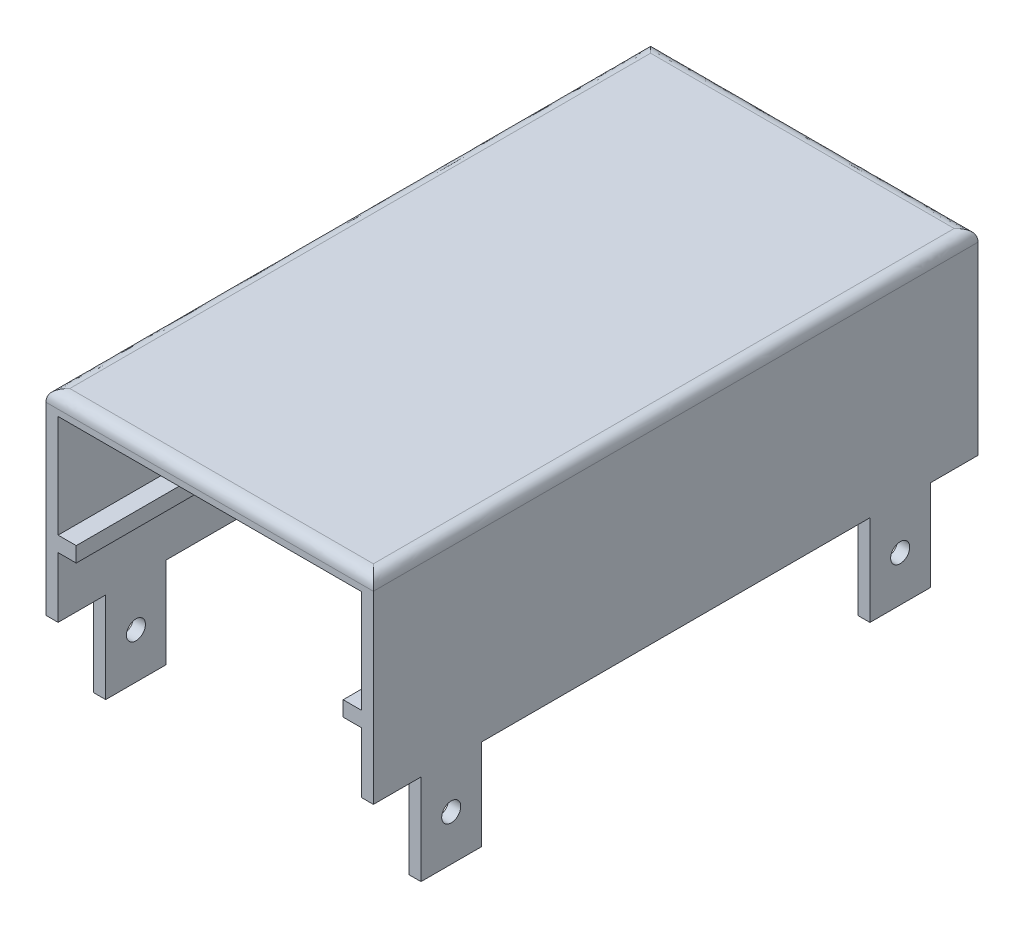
ISO-10303-21;
HEADER;
FILE_DESCRIPTION(('STEP AP214'),'2;1');
FILE_NAME('part.step','',(''),(''),'','','');
FILE_SCHEMA(('AUTOMOTIVE_DESIGN { 1 0 10303 214 1 1 1 1 }'));
ENDSEC;
DATA;
#1=APPLICATION_CONTEXT('core data for automotive mechanical design processes');
#2=APPLICATION_PROTOCOL_DEFINITION('international standard','automotive_design',2000,#1);
#3=PRODUCT_CONTEXT('',#1,'mechanical');
#4=PRODUCT('Part','Part','',(#3));
#5=PRODUCT_RELATED_PRODUCT_CATEGORY('part','',(#4));
#6=PRODUCT_DEFINITION_FORMATION('','',#4);
#7=PRODUCT_DEFINITION_CONTEXT('part definition',#1,'design');
#8=PRODUCT_DEFINITION('design','',#6,#7);
#9=PRODUCT_DEFINITION_SHAPE('','',#8);
#10=(LENGTH_UNIT() NAMED_UNIT(*) SI_UNIT(.MILLI.,.METRE.));
#11=(NAMED_UNIT(*) PLANE_ANGLE_UNIT() SI_UNIT($,.RADIAN.));
#12=(NAMED_UNIT(*) SI_UNIT($,.STERADIAN.) SOLID_ANGLE_UNIT());
#13=UNCERTAINTY_MEASURE_WITH_UNIT(LENGTH_MEASURE(1.E-05),#10,'distance_accuracy_value','');
#14=(GEOMETRIC_REPRESENTATION_CONTEXT(3) GLOBAL_UNCERTAINTY_ASSIGNED_CONTEXT((#13)) GLOBAL_UNIT_ASSIGNED_CONTEXT((#10,
#11,#12)) REPRESENTATION_CONTEXT('',''));
#15=CARTESIAN_POINT('',(0.,0.,0.));
#16=DIRECTION('',(0.,0.,1.));
#17=DIRECTION('',(1.,0.,0.));
#18=AXIS2_PLACEMENT_3D('',#15,#16,#17);
#19=CARTESIAN_POINT('',(100.012355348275,-14.410612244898,254.));
#20=DIRECTION('',(0.,1.,0.));
#21=DIRECTION('',(0.,0.,1.));
#22=AXIS2_PLACEMENT_3D('',#19,#20,#21);
#23=PLANE('',#22);
#24=DIRECTION('',(-1.,0.,0.));
#25=VECTOR('',#24,1.);
#26=CARTESIAN_POINT('',(100.012355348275,-14.410612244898,234.));
#27=LINE('',#26,#25);
#28=CARTESIAN_POINT('',(100.012355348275,-14.410612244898,234.));
#29=VERTEX_POINT('',#28);
#30=CARTESIAN_POINT('',(94.9323553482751,-14.410612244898,234.));
#31=VERTEX_POINT('',#30);
#32=EDGE_CURVE('E294',#29,#31,#27,.T.);
#33=ORIENTED_EDGE('',*,*,#32,.F.);
#34=DIRECTION('',(0.,0.,-1.));
#35=VECTOR('',#34,1.);
#36=CARTESIAN_POINT('',(100.012355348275,-14.410612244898,254.));
#37=LINE('',#36,#35);
#38=CARTESIAN_POINT('',(100.012355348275,-14.410612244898,254.));
#39=VERTEX_POINT('',#38);
#40=EDGE_CURVE('E308',#39,#29,#37,.T.);
#41=ORIENTED_EDGE('',*,*,#40,.F.);
#42=DIRECTION('',(1.,0.,0.));
#43=VECTOR('',#42,1.);
#44=CARTESIAN_POINT('',(100.012355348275,-14.410612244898,254.));
#45=LINE('',#44,#43);
#46=CARTESIAN_POINT('',(94.9323553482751,-14.410612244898,254.));
#47=VERTEX_POINT('',#46);
#48=EDGE_CURVE('E846',#47,#39,#45,.T.);
#49=ORIENTED_EDGE('',*,*,#48,.F.);
#50=DIRECTION('',(0.,0.,-1.));
#51=VECTOR('',#50,1.);
#52=CARTESIAN_POINT('',(94.9323553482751,-14.410612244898,254.));
#53=LINE('',#52,#51);
#54=EDGE_CURVE('E303',#47,#31,#53,.T.);
#55=ORIENTED_EDGE('',*,*,#54,.T.);
#56=EDGE_LOOP('',(#33,#41,#49,#55));
#57=FACE_BOUND('',#56,.T.);
#58=ADVANCED_FACE('F51',(#57),#23,.F.);
#59=DIRECTION('',(1.,0.,0.));
#60=VECTOR('',#59,1.);
#61=CARTESIAN_POINT('',(100.012355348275,-14.410612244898,208.6));
#62=LINE('',#61,#60);
#63=CARTESIAN_POINT('',(94.9323553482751,-14.410612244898,208.6));
#64=VERTEX_POINT('',#63);
#65=CARTESIAN_POINT('',(100.012355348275,-14.410612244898,208.6));
#66=VERTEX_POINT('',#65);
#67=EDGE_CURVE('E280',#64,#66,#62,.T.);
#68=ORIENTED_EDGE('',*,*,#67,.F.);
#69=CARTESIAN_POINT('',(94.9323553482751,-14.410612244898,45.4));
#70=VERTEX_POINT('',#69);
#71=EDGE_CURVE('E291',#64,#70,#53,.T.);
#72=ORIENTED_EDGE('',*,*,#71,.T.);
#73=DIRECTION('',(-1.,0.,0.));
#74=VECTOR('',#73,1.);
#75=CARTESIAN_POINT('',(100.012355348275,-14.410612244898,45.4));
#76=LINE('',#75,#74);
#77=CARTESIAN_POINT('',(100.012355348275,-14.410612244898,45.4));
#78=VERTEX_POINT('',#77);
#79=EDGE_CURVE('E546',#78,#70,#76,.T.);
#80=ORIENTED_EDGE('',*,*,#79,.F.);
#81=EDGE_CURVE('E293',#66,#78,#37,.T.);
#82=ORIENTED_EDGE('',*,*,#81,.F.);
#83=EDGE_LOOP('',(#68,#72,#80,#82));
#84=FACE_BOUND('',#83,.T.);
#85=ADVANCED_FACE('F289',(#84),#23,.F.);
#86=DIRECTION('',(1.,0.,0.));
#87=VECTOR('',#86,1.);
#88=CARTESIAN_POINT('',(100.012355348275,-14.410612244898,20.));
#89=LINE('',#88,#87);
#90=CARTESIAN_POINT('',(94.9323553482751,-14.410612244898,20.));
#91=VERTEX_POINT('',#90);
#92=CARTESIAN_POINT('',(100.012355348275,-14.410612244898,20.));
#93=VERTEX_POINT('',#92);
#94=EDGE_CURVE('E542',#91,#93,#89,.T.);
#95=ORIENTED_EDGE('',*,*,#94,.F.);
#96=CARTESIAN_POINT('',(94.9323553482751,-14.410612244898,0.));
#97=VERTEX_POINT('',#96);
#98=EDGE_CURVE('E304',#91,#97,#53,.T.);
#99=ORIENTED_EDGE('',*,*,#98,.T.);
#100=DIRECTION('',(1.,0.,0.));
#101=VECTOR('',#100,1.);
#102=CARTESIAN_POINT('',(100.012355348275,-14.410612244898,0.));
#103=LINE('',#102,#101);
#104=CARTESIAN_POINT('',(100.012355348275,-14.410612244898,0.));
#105=VERTEX_POINT('',#104);
#106=EDGE_CURVE('E404',#97,#105,#103,.T.);
#107=ORIENTED_EDGE('',*,*,#106,.T.);
#108=EDGE_CURVE('E545',#93,#105,#37,.T.);
#109=ORIENTED_EDGE('',*,*,#108,.F.);
#110=EDGE_LOOP('',(#95,#99,#107,#109));
#111=FACE_BOUND('',#110,.T.);
#112=ADVANCED_FACE('F523',(#111),#23,.F.);
#113=CARTESIAN_POINT('',(-32.4497959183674,-14.410612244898,254.));
#114=DIRECTION('',(0.,1.,0.));
#115=DIRECTION('',(0.,0.,1.));
#116=AXIS2_PLACEMENT_3D('',#113,#114,#115);
#117=PLANE('',#116);
#118=DIRECTION('',(1.,0.,0.));
#119=VECTOR('',#118,1.);
#120=CARTESIAN_POINT('',(-37.5297959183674,-14.410612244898,20.));
#121=LINE('',#120,#119);
#122=CARTESIAN_POINT('',(-37.5297959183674,-14.410612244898,20.));
#123=VERTEX_POINT('',#122);
#124=CARTESIAN_POINT('',(-32.4497959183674,-14.410612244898,20.));
#125=VERTEX_POINT('',#124);
#126=EDGE_CURVE('E785',#123,#125,#121,.T.);
#127=ORIENTED_EDGE('',*,*,#126,.F.);
#128=DIRECTION('',(0.,0.,-1.));
#129=VECTOR('',#128,1.);
#130=CARTESIAN_POINT('',(-37.5297959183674,-14.410612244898,254.));
#131=LINE('',#130,#129);
#132=CARTESIAN_POINT('',(-37.5297959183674,-14.410612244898,0.));
#133=VERTEX_POINT('',#132);
#134=EDGE_CURVE('E856',#123,#133,#131,.T.);
#135=ORIENTED_EDGE('',*,*,#134,.T.);
#136=DIRECTION('',(1.,0.,0.));
#137=VECTOR('',#136,1.);
#138=CARTESIAN_POINT('',(-32.4497959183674,-14.410612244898,0.));
#139=LINE('',#138,#137);
#140=CARTESIAN_POINT('',(-32.4497959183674,-14.410612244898,0.));
#141=VERTEX_POINT('',#140);
#142=EDGE_CURVE('E851',#133,#141,#139,.T.);
#143=ORIENTED_EDGE('',*,*,#142,.T.);
#144=DIRECTION('',(0.,0.,-1.));
#145=VECTOR('',#144,1.);
#146=CARTESIAN_POINT('',(-32.4497959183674,-14.410612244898,254.));
#147=LINE('',#146,#145);
#148=EDGE_CURVE('E341',#125,#141,#147,.T.);
#149=ORIENTED_EDGE('',*,*,#148,.F.);
#150=EDGE_LOOP('',(#127,#135,#143,#149));
#151=FACE_BOUND('',#150,.T.);
#152=ADVANCED_FACE('F531',(#151),#117,.F.);
#153=DIRECTION('',(-1.,0.,0.));
#154=VECTOR('',#153,1.);
#155=CARTESIAN_POINT('',(-37.5297959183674,-14.410612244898,45.4));
#156=LINE('',#155,#154);
#157=CARTESIAN_POINT('',(-32.4497959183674,-14.410612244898,45.4));
#158=VERTEX_POINT('',#157);
#159=CARTESIAN_POINT('',(-37.5297959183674,-14.410612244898,45.4));
#160=VERTEX_POINT('',#159);
#161=EDGE_CURVE('E782',#158,#160,#156,.T.);
#162=ORIENTED_EDGE('',*,*,#161,.F.);
#163=CARTESIAN_POINT('',(-32.4497959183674,-14.410612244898,208.6));
#164=VERTEX_POINT('',#163);
#165=EDGE_CURVE('E346',#164,#158,#147,.T.);
#166=ORIENTED_EDGE('',*,*,#165,.F.);
#167=DIRECTION('',(1.,0.,0.));
#168=VECTOR('',#167,1.);
#169=CARTESIAN_POINT('',(-37.5297959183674,-14.410612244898,208.6));
#170=LINE('',#169,#168);
#171=CARTESIAN_POINT('',(-37.5297959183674,-14.410612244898,208.6));
#172=VERTEX_POINT('',#171);
#173=EDGE_CURVE('E789',#172,#164,#170,.T.);
#174=ORIENTED_EDGE('',*,*,#173,.F.);
#175=EDGE_CURVE('E864',#172,#160,#131,.T.);
#176=ORIENTED_EDGE('',*,*,#175,.T.);
#177=EDGE_LOOP('',(#162,#166,#174,#176));
#178=FACE_BOUND('',#177,.T.);
#179=ADVANCED_FACE('F536',(#178),#117,.F.);
#180=DIRECTION('',(-1.,0.,0.));
#181=VECTOR('',#180,1.);
#182=CARTESIAN_POINT('',(-37.5297959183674,-14.410612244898,234.));
#183=LINE('',#182,#181);
#184=CARTESIAN_POINT('',(-32.4497959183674,-14.410612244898,234.));
#185=VERTEX_POINT('',#184);
#186=CARTESIAN_POINT('',(-37.5297959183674,-14.410612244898,234.));
#187=VERTEX_POINT('',#186);
#188=EDGE_CURVE('E801',#185,#187,#183,.T.);
#189=ORIENTED_EDGE('',*,*,#188,.F.);
#190=CARTESIAN_POINT('',(-32.4497959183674,-14.410612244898,254.));
#191=VERTEX_POINT('',#190);
#192=EDGE_CURVE('E342',#191,#185,#147,.T.);
#193=ORIENTED_EDGE('',*,*,#192,.F.);
#194=DIRECTION('',(1.,0.,0.));
#195=VECTOR('',#194,1.);
#196=CARTESIAN_POINT('',(-32.4497959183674,-14.410612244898,254.));
#197=LINE('',#196,#195);
#198=CARTESIAN_POINT('',(-37.5297959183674,-14.410612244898,254.));
#199=VERTEX_POINT('',#198);
#200=EDGE_CURVE('E418',#199,#191,#197,.T.);
#201=ORIENTED_EDGE('',*,*,#200,.F.);
#202=EDGE_CURVE('E413',#199,#187,#131,.T.);
#203=ORIENTED_EDGE('',*,*,#202,.T.);
#204=EDGE_LOOP('',(#189,#193,#201,#203));
#205=FACE_BOUND('',#204,.T.);
#206=ADVANCED_FACE('F539',(#205),#117,.F.);
#207=CARTESIAN_POINT('',(-32.4497959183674,10.989387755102,254.));
#208=DIRECTION('',(-1.,0.,0.));
#209=DIRECTION('',(0.,-1.,0.));
#210=AXIS2_PLACEMENT_3D('',#207,#208,#209);
#211=PLANE('',#210);
#212=CARTESIAN_POINT('',(-32.4497959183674,-33.460612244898,221.3));
#213=DIRECTION('',(-1.,0.,0.));
#214=DIRECTION('',(0.,-1.,0.));
#215=AXIS2_PLACEMENT_3D('',#212,#213,#214);
#216=CIRCLE('',#215,3.99999999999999);
#217=CARTESIAN_POINT('',(-32.4497959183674,-37.460612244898,221.3));
#218=VERTEX_POINT('',#217);
#219=EDGE_CURVE('E738',#218,#218,#216,.T.);
#220=ORIENTED_EDGE('',*,*,#219,.T.);
#221=EDGE_LOOP('',(#220));
#222=FACE_BOUND('',#221,.T.);
#223=CARTESIAN_POINT('',(-32.4497959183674,-33.460612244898,32.7));
#224=DIRECTION('',(-1.,0.,0.));
#225=DIRECTION('',(0.,-1.,0.));
#226=AXIS2_PLACEMENT_3D('',#223,#224,#225);
#227=CIRCLE('',#226,4.);
#228=CARTESIAN_POINT('',(-32.4497959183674,-37.460612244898,32.7));
#229=VERTEX_POINT('',#228);
#230=EDGE_CURVE('E726',#229,#229,#227,.T.);
#231=ORIENTED_EDGE('',*,*,#230,.T.);
#232=EDGE_LOOP('',(#231));
#233=FACE_BOUND('',#232,.T.);
#234=DIRECTION('',(0.,1.,0.));
#235=VECTOR('',#234,1.);
#236=CARTESIAN_POINT('',(-32.4497959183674,10.989387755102,0.));
#237=LINE('',#236,#235);
#238=CARTESIAN_POINT('',(-32.4497959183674,10.989387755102,0.));
#239=VERTEX_POINT('',#238);
#240=EDGE_CURVE('E872',#141,#239,#237,.T.);
#241=ORIENTED_EDGE('',*,*,#240,.T.);
#242=DIRECTION('',(0.,0.,-1.));
#243=VECTOR('',#242,1.);
#244=CARTESIAN_POINT('',(-32.4497959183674,10.989387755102,254.));
#245=LINE('',#244,#243);
#246=CARTESIAN_POINT('',(-32.4497959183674,10.989387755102,254.));
#247=VERTEX_POINT('',#246);
#248=EDGE_CURVE('E338',#247,#239,#245,.T.);
#249=ORIENTED_EDGE('',*,*,#248,.F.);
#250=DIRECTION('',(0.,1.,0.));
#251=VECTOR('',#250,1.);
#252=CARTESIAN_POINT('',(-32.4497959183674,10.989387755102,254.));
#253=LINE('',#252,#251);
#254=EDGE_CURVE('E824',#191,#247,#253,.T.);
#255=ORIENTED_EDGE('',*,*,#254,.F.);
#256=ORIENTED_EDGE('',*,*,#192,.T.);
#257=DIRECTION('',(0.,1.,0.));
#258=VECTOR('',#257,1.);
#259=CARTESIAN_POINT('',(-32.4497959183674,-52.510612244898,234.));
#260=LINE('',#259,#258);
#261=CARTESIAN_POINT('',(-32.4497959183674,-52.510612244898,234.));
#262=VERTEX_POINT('',#261);
#263=EDGE_CURVE('E814',#262,#185,#260,.T.);
#264=ORIENTED_EDGE('',*,*,#263,.F.);
#265=DIRECTION('',(0.,0.,1.));
#266=VECTOR('',#265,1.);
#267=CARTESIAN_POINT('',(-32.4497959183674,-52.510612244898,234.));
#268=LINE('',#267,#266);
#269=CARTESIAN_POINT('',(-32.4497959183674,-52.510612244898,208.6));
#270=VERTEX_POINT('',#269);
#271=EDGE_CURVE('E803',#270,#262,#268,.T.);
#272=ORIENTED_EDGE('',*,*,#271,.F.);
#273=DIRECTION('',(0.,1.,0.));
#274=VECTOR('',#273,1.);
#275=CARTESIAN_POINT('',(-32.4497959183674,-52.510612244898,208.6));
#276=LINE('',#275,#274);
#277=EDGE_CURVE('E817',#270,#164,#276,.T.);
#278=ORIENTED_EDGE('',*,*,#277,.T.);
#279=ORIENTED_EDGE('',*,*,#165,.T.);
#280=DIRECTION('',(0.,1.,0.));
#281=VECTOR('',#280,1.);
#282=CARTESIAN_POINT('',(-32.4497959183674,-52.510612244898,45.4));
#283=LINE('',#282,#281);
#284=CARTESIAN_POINT('',(-32.4497959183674,-52.510612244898,45.4));
#285=VERTEX_POINT('',#284);
#286=EDGE_CURVE('E775',#285,#158,#283,.T.);
#287=ORIENTED_EDGE('',*,*,#286,.F.);
#288=DIRECTION('',(0.,0.,1.));
#289=VECTOR('',#288,1.);
#290=CARTESIAN_POINT('',(-32.4497959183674,-52.510612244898,45.4));
#291=LINE('',#290,#289);
#292=CARTESIAN_POINT('',(-32.4497959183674,-52.510612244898,20.));
#293=VERTEX_POINT('',#292);
#294=EDGE_CURVE('E791',#293,#285,#291,.T.);
#295=ORIENTED_EDGE('',*,*,#294,.F.);
#296=DIRECTION('',(0.,1.,0.));
#297=VECTOR('',#296,1.);
#298=CARTESIAN_POINT('',(-32.4497959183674,-52.510612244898,20.));
#299=LINE('',#298,#297);
#300=EDGE_CURVE('E772',#293,#125,#299,.T.);
#301=ORIENTED_EDGE('',*,*,#300,.T.);
#302=ORIENTED_EDGE('',*,*,#148,.T.);
#303=EDGE_LOOP('',(#241,#249,#255,#256,#264,#272,#278,#279,#287,#295,#301,#302));
#304=FACE_BOUND('',#303,.T.);
#305=ADVANCED_FACE('F870',(#222,#233,#304),#211,.F.);
#306=CARTESIAN_POINT('',(-24.8297959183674,10.989387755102,254.));
#307=DIRECTION('',(0.,1.,0.));
#308=DIRECTION('',(0.,0.,1.));
#309=AXIS2_PLACEMENT_3D('',#306,#307,#308);
#310=PLANE('',#309);
#311=DIRECTION('',(1.,0.,0.));
#312=VECTOR('',#311,1.);
#313=CARTESIAN_POINT('',(-24.8297959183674,10.989387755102,0.));
#314=LINE('',#313,#312);
#315=CARTESIAN_POINT('',(-24.8297959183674,10.989387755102,0.));
#316=VERTEX_POINT('',#315);
#317=EDGE_CURVE('E877',#239,#316,#314,.T.);
#318=ORIENTED_EDGE('',*,*,#317,.T.);
#319=DIRECTION('',(0.,0.,-1.));
#320=VECTOR('',#319,1.);
#321=CARTESIAN_POINT('',(-24.8297959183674,10.989387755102,254.));
#322=LINE('',#321,#320);
#323=CARTESIAN_POINT('',(-24.8297959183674,10.989387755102,254.));
#324=VERTEX_POINT('',#323);
#325=EDGE_CURVE('E335',#324,#316,#322,.T.);
#326=ORIENTED_EDGE('',*,*,#325,.F.);
#327=DIRECTION('',(1.,0.,0.));
#328=VECTOR('',#327,1.);
#329=CARTESIAN_POINT('',(-24.8297959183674,10.989387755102,254.));
#330=LINE('',#329,#328);
#331=EDGE_CURVE('E826',#247,#324,#330,.T.);
#332=ORIENTED_EDGE('',*,*,#331,.F.);
#333=ORIENTED_EDGE('',*,*,#248,.T.);
#334=EDGE_LOOP('',(#318,#326,#332,#333));
#335=FACE_BOUND('',#334,.T.);
#336=ADVANCED_FACE('F875',(#335),#310,.F.);
#337=CARTESIAN_POINT('',(-24.8297959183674,10.989387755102,254.));
#338=DIRECTION('',(-1.,0.,0.));
#339=DIRECTION('',(0.,0.,1.));
#340=AXIS2_PLACEMENT_3D('',#337,#338,#339);
#341=PLANE('',#340);
#342=DIRECTION('',(0.,1.,0.));
#343=VECTOR('',#342,1.);
#344=CARTESIAN_POINT('',(-24.8297959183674,10.989387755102,0.));
#345=LINE('',#344,#343);
#346=CARTESIAN_POINT('',(-24.8297959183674,17.339387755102,0.));
#347=VERTEX_POINT('',#346);
#348=EDGE_CURVE('E936',#316,#347,#345,.T.);
#349=ORIENTED_EDGE('',*,*,#348,.T.);
#350=DIRECTION('',(0.,0.,-1.));
#351=VECTOR('',#350,1.);
#352=CARTESIAN_POINT('',(-24.8297959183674,17.339387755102,254.));
#353=LINE('',#352,#351);
#354=CARTESIAN_POINT('',(-24.8297959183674,17.339387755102,254.));
#355=VERTEX_POINT('',#354);
#356=EDGE_CURVE('E332',#355,#347,#353,.T.);
#357=ORIENTED_EDGE('',*,*,#356,.F.);
#358=DIRECTION('',(0.,1.,0.));
#359=VECTOR('',#358,1.);
#360=CARTESIAN_POINT('',(-24.8297959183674,10.989387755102,254.));
#361=LINE('',#360,#359);
#362=EDGE_CURVE('E828',#324,#355,#361,.T.);
#363=ORIENTED_EDGE('',*,*,#362,.F.);
#364=ORIENTED_EDGE('',*,*,#325,.T.);
#365=EDGE_LOOP('',(#349,#357,#363,#364));
#366=FACE_BOUND('',#365,.T.);
#367=ADVANCED_FACE('F881',(#366),#341,.F.);
#368=CARTESIAN_POINT('',(-32.4497959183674,17.339387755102,254.));
#369=DIRECTION('',(0.,-1.,0.));
#370=DIRECTION('',(1.,0.,0.));
#371=AXIS2_PLACEMENT_3D('',#368,#369,#370);
#372=PLANE('',#371);
#373=DIRECTION('',(-1.,0.,0.));
#374=VECTOR('',#373,1.);
#375=CARTESIAN_POINT('',(-32.4497959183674,17.339387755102,0.));
#376=LINE('',#375,#374);
#377=CARTESIAN_POINT('',(-32.4497959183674,17.339387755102,0.));
#378=VERTEX_POINT('',#377);
#379=EDGE_CURVE('E889',#347,#378,#376,.T.);
#380=ORIENTED_EDGE('',*,*,#379,.T.);
#381=DIRECTION('',(0.,0.,-1.));
#382=VECTOR('',#381,1.);
#383=CARTESIAN_POINT('',(-32.4497959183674,17.339387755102,254.));
#384=LINE('',#383,#382);
#385=CARTESIAN_POINT('',(-32.4497959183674,17.339387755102,254.));
#386=VERTEX_POINT('',#385);
#387=EDGE_CURVE('E329',#386,#378,#384,.T.);
#388=ORIENTED_EDGE('',*,*,#387,.F.);
#389=DIRECTION('',(-1.,0.,0.));
#390=VECTOR('',#389,1.);
#391=CARTESIAN_POINT('',(-32.4497959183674,17.339387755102,254.));
#392=LINE('',#391,#390);
#393=EDGE_CURVE('E830',#355,#386,#392,.T.);
#394=ORIENTED_EDGE('',*,*,#393,.F.);
#395=ORIENTED_EDGE('',*,*,#356,.T.);
#396=EDGE_LOOP('',(#380,#388,#394,#395));
#397=FACE_BOUND('',#396,.T.);
#398=ADVANCED_FACE('F887',(#397),#372,.F.);
#399=CARTESIAN_POINT('',(-32.4497959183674,60.519387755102,254.));
#400=DIRECTION('',(-1.,0.,0.));
#401=DIRECTION('',(0.,-1.,0.));
#402=AXIS2_PLACEMENT_3D('',#399,#400,#401);
#403=PLANE('',#402);
#404=DIRECTION('',(0.,1.,0.));
#405=VECTOR('',#404,1.);
#406=CARTESIAN_POINT('',(-32.4497959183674,60.519387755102,0.));
#407=LINE('',#406,#405);
#408=CARTESIAN_POINT('',(-32.4497959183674,60.519387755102,0.));
#409=VERTEX_POINT('',#408);
#410=EDGE_CURVE('E894',#378,#409,#407,.T.);
#411=ORIENTED_EDGE('',*,*,#410,.T.);
#412=DIRECTION('',(0.,0.,-1.));
#413=VECTOR('',#412,1.);
#414=CARTESIAN_POINT('',(-32.4497959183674,60.519387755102,254.));
#415=LINE('',#414,#413);
#416=CARTESIAN_POINT('',(-32.4497959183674,60.519387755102,254.));
#417=VERTEX_POINT('',#416);
#418=EDGE_CURVE('E326',#417,#409,#415,.T.);
#419=ORIENTED_EDGE('',*,*,#418,.F.);
#420=DIRECTION('',(0.,1.,0.));
#421=VECTOR('',#420,1.);
#422=CARTESIAN_POINT('',(-32.4497959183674,60.519387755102,254.));
#423=LINE('',#422,#421);
#424=EDGE_CURVE('E832',#386,#417,#423,.T.);
#425=ORIENTED_EDGE('',*,*,#424,.F.);
#426=ORIENTED_EDGE('',*,*,#387,.T.);
#427=EDGE_LOOP('',(#411,#419,#425,#426));
#428=FACE_BOUND('',#427,.T.);
#429=ADVANCED_FACE('F892',(#428),#403,.F.);
#430=CARTESIAN_POINT('',(94.9323553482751,60.519387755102,254.));
#431=DIRECTION('',(0.,1.,0.));
#432=DIRECTION('',(0.,0.,1.));
#433=AXIS2_PLACEMENT_3D('',#430,#431,#432);
#434=PLANE('',#433);
#435=DIRECTION('',(1.,0.,0.));
#436=VECTOR('',#435,1.);
#437=CARTESIAN_POINT('',(94.9323553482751,60.519387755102,0.));
#438=LINE('',#437,#436);
#439=CARTESIAN_POINT('',(94.9323553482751,60.519387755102,0.));
#440=VERTEX_POINT('',#439);
#441=EDGE_CURVE('E932',#409,#440,#438,.T.);
#442=ORIENTED_EDGE('',*,*,#441,.T.);
#443=DIRECTION('',(0.,0.,-1.));
#444=VECTOR('',#443,1.);
#445=CARTESIAN_POINT('',(94.9323553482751,60.519387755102,254.));
#446=LINE('',#445,#444);
#447=CARTESIAN_POINT('',(94.9323553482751,60.519387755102,254.));
#448=VERTEX_POINT('',#447);
#449=EDGE_CURVE('E323',#448,#440,#446,.T.);
#450=ORIENTED_EDGE('',*,*,#449,.F.);
#451=DIRECTION('',(1.,0.,0.));
#452=VECTOR('',#451,1.);
#453=CARTESIAN_POINT('',(94.9323553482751,60.519387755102,254.));
#454=LINE('',#453,#452);
#455=EDGE_CURVE('E834',#417,#448,#454,.T.);
#456=ORIENTED_EDGE('',*,*,#455,.F.);
#457=ORIENTED_EDGE('',*,*,#418,.T.);
#458=EDGE_LOOP('',(#442,#450,#456,#457));
#459=FACE_BOUND('',#458,.T.);
#460=ADVANCED_FACE('F898',(#459),#434,.F.);
#461=CARTESIAN_POINT('',(94.9323553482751,60.519387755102,254.));
#462=DIRECTION('',(1.,0.,0.));
#463=DIRECTION('',(0.,0.,-1.));
#464=AXIS2_PLACEMENT_3D('',#461,#462,#463);
#465=PLANE('',#464);
#466=DIRECTION('',(0.,-1.,0.));
#467=VECTOR('',#466,1.);
#468=CARTESIAN_POINT('',(94.9323553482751,60.519387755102,0.));
#469=LINE('',#468,#467);
#470=CARTESIAN_POINT('',(94.9323553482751,17.339387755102,0.));
#471=VERTEX_POINT('',#470);
#472=EDGE_CURVE('E906',#440,#471,#469,.T.);
#473=ORIENTED_EDGE('',*,*,#472,.T.);
#474=DIRECTION('',(0.,0.,-1.));
#475=VECTOR('',#474,1.);
#476=CARTESIAN_POINT('',(94.9323553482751,17.339387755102,254.));
#477=LINE('',#476,#475);
#478=CARTESIAN_POINT('',(94.9323553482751,17.339387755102,254.));
#479=VERTEX_POINT('',#478);
#480=EDGE_CURVE('E320',#479,#471,#477,.T.);
#481=ORIENTED_EDGE('',*,*,#480,.F.);
#482=DIRECTION('',(0.,-1.,0.));
#483=VECTOR('',#482,1.);
#484=CARTESIAN_POINT('',(94.9323553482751,60.519387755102,254.));
#485=LINE('',#484,#483);
#486=EDGE_CURVE('E836',#448,#479,#485,.T.);
#487=ORIENTED_EDGE('',*,*,#486,.F.);
#488=ORIENTED_EDGE('',*,*,#449,.T.);
#489=EDGE_LOOP('',(#473,#481,#487,#488));
#490=FACE_BOUND('',#489,.T.);
#491=ADVANCED_FACE('F904',(#490),#465,.F.);
#492=CARTESIAN_POINT('',(87.3123553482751,17.339387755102,254.));
#493=DIRECTION('',(0.,-1.,0.));
#494=DIRECTION('',(1.,0.,0.));
#495=AXIS2_PLACEMENT_3D('',#492,#493,#494);
#496=PLANE('',#495);
#497=DIRECTION('',(-1.,0.,0.));
#498=VECTOR('',#497,1.);
#499=CARTESIAN_POINT('',(87.3123553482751,17.339387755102,0.));
#500=LINE('',#499,#498);
#501=CARTESIAN_POINT('',(87.3123553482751,17.339387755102,0.));
#502=VERTEX_POINT('',#501);
#503=EDGE_CURVE('E911',#471,#502,#500,.T.);
#504=ORIENTED_EDGE('',*,*,#503,.T.);
#505=DIRECTION('',(0.,0.,-1.));
#506=VECTOR('',#505,1.);
#507=CARTESIAN_POINT('',(87.3123553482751,17.339387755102,254.));
#508=LINE('',#507,#506);
#509=CARTESIAN_POINT('',(87.3123553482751,17.339387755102,254.));
#510=VERTEX_POINT('',#509);
#511=EDGE_CURVE('E317',#510,#502,#508,.T.);
#512=ORIENTED_EDGE('',*,*,#511,.F.);
#513=DIRECTION('',(-1.,0.,0.));
#514=VECTOR('',#513,1.);
#515=CARTESIAN_POINT('',(87.3123553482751,17.339387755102,254.));
#516=LINE('',#515,#514);
#517=EDGE_CURVE('E838',#479,#510,#516,.T.);
#518=ORIENTED_EDGE('',*,*,#517,.F.);
#519=ORIENTED_EDGE('',*,*,#480,.T.);
#520=EDGE_LOOP('',(#504,#512,#518,#519));
#521=FACE_BOUND('',#520,.T.);
#522=ADVANCED_FACE('F909',(#521),#496,.F.);
#523=CARTESIAN_POINT('',(87.3123553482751,17.339387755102,254.));
#524=DIRECTION('',(1.,0.,0.));
#525=DIRECTION('',(0.,0.,-1.));
#526=AXIS2_PLACEMENT_3D('',#523,#524,#525);
#527=PLANE('',#526);
#528=DIRECTION('',(0.,-1.,0.));
#529=VECTOR('',#528,1.);
#530=CARTESIAN_POINT('',(87.3123553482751,17.339387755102,0.));
#531=LINE('',#530,#529);
#532=CARTESIAN_POINT('',(87.3123553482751,10.989387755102,0.));
#533=VERTEX_POINT('',#532);
#534=EDGE_CURVE('E926',#502,#533,#531,.T.);
#535=ORIENTED_EDGE('',*,*,#534,.T.);
#536=DIRECTION('',(0.,0.,-1.));
#537=VECTOR('',#536,1.);
#538=CARTESIAN_POINT('',(87.3123553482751,10.989387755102,254.));
#539=LINE('',#538,#537);
#540=CARTESIAN_POINT('',(87.3123553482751,10.989387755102,254.));
#541=VERTEX_POINT('',#540);
#542=EDGE_CURVE('E314',#541,#533,#539,.T.);
#543=ORIENTED_EDGE('',*,*,#542,.F.);
#544=DIRECTION('',(0.,-1.,0.));
#545=VECTOR('',#544,1.);
#546=CARTESIAN_POINT('',(87.3123553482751,17.339387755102,254.));
#547=LINE('',#546,#545);
#548=EDGE_CURVE('E840',#510,#541,#547,.T.);
#549=ORIENTED_EDGE('',*,*,#548,.F.);
#550=ORIENTED_EDGE('',*,*,#511,.T.);
#551=EDGE_LOOP('',(#535,#543,#549,#550));
#552=FACE_BOUND('',#551,.T.);
#553=ADVANCED_FACE('F915',(#552),#527,.F.);
#554=CARTESIAN_POINT('',(94.9323553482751,10.989387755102,254.));
#555=DIRECTION('',(0.,1.,0.));
#556=DIRECTION('',(0.,0.,1.));
#557=AXIS2_PLACEMENT_3D('',#554,#555,#556);
#558=PLANE('',#557);
#559=DIRECTION('',(1.,0.,0.));
#560=VECTOR('',#559,1.);
#561=CARTESIAN_POINT('',(94.9323553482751,10.989387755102,0.));
#562=LINE('',#561,#560);
#563=CARTESIAN_POINT('',(94.9323553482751,10.989387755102,0.));
#564=VERTEX_POINT('',#563);
#565=EDGE_CURVE('E558',#533,#564,#562,.T.);
#566=ORIENTED_EDGE('',*,*,#565,.T.);
#567=DIRECTION('',(0.,0.,-1.));
#568=VECTOR('',#567,1.);
#569=CARTESIAN_POINT('',(94.9323553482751,10.989387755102,254.));
#570=LINE('',#569,#568);
#571=CARTESIAN_POINT('',(94.9323553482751,10.989387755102,254.));
#572=VERTEX_POINT('',#571);
#573=EDGE_CURVE('E307',#572,#564,#570,.T.);
#574=ORIENTED_EDGE('',*,*,#573,.F.);
#575=DIRECTION('',(1.,0.,0.));
#576=VECTOR('',#575,1.);
#577=CARTESIAN_POINT('',(94.9323553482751,10.989387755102,254.));
#578=LINE('',#577,#576);
#579=EDGE_CURVE('E842',#541,#572,#578,.T.);
#580=ORIENTED_EDGE('',*,*,#579,.F.);
#581=ORIENTED_EDGE('',*,*,#542,.T.);
#582=EDGE_LOOP('',(#566,#574,#580,#581));
#583=FACE_BOUND('',#582,.T.);
#584=ADVANCED_FACE('F919',(#583),#558,.F.);
#585=CARTESIAN_POINT('',(94.9323553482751,-14.410612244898,254.));
#586=DIRECTION('',(1.,0.,0.));
#587=DIRECTION('',(0.,0.,-1.));
#588=AXIS2_PLACEMENT_3D('',#585,#586,#587);
#589=PLANE('',#588);
#590=CARTESIAN_POINT('',(94.9323553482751,-33.460612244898,221.3));
#591=DIRECTION('',(1.,0.,0.));
#592=DIRECTION('',(0.,0.,-1.));
#593=AXIS2_PLACEMENT_3D('',#590,#591,#592);
#594=CIRCLE('',#593,3.99999999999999);
#595=CARTESIAN_POINT('',(94.9323553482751,-33.460612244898,217.3));
#596=VERTEX_POINT('',#595);
#597=EDGE_CURVE('E735',#596,#596,#594,.T.);
#598=ORIENTED_EDGE('',*,*,#597,.T.);
#599=EDGE_LOOP('',(#598));
#600=FACE_BOUND('',#599,.T.);
#601=CARTESIAN_POINT('',(94.9323553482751,-33.460612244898,32.7));
#602=DIRECTION('',(1.,0.,0.));
#603=DIRECTION('',(0.,0.,-1.));
#604=AXIS2_PLACEMENT_3D('',#601,#602,#603);
#605=CIRCLE('',#604,4.);
#606=CARTESIAN_POINT('',(94.9323553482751,-33.460612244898,28.7));
#607=VERTEX_POINT('',#606);
#608=EDGE_CURVE('E721',#607,#607,#605,.T.);
#609=ORIENTED_EDGE('',*,*,#608,.T.);
#610=EDGE_LOOP('',(#609));
#611=FACE_BOUND('',#610,.T.);
#612=DIRECTION('',(0.,-1.,0.));
#613=VECTOR('',#612,1.);
#614=CARTESIAN_POINT('',(94.9323553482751,-14.410612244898,0.));
#615=LINE('',#614,#613);
#616=EDGE_CURVE('E553',#564,#97,#615,.T.);
#617=ORIENTED_EDGE('',*,*,#616,.T.);
#618=ORIENTED_EDGE('',*,*,#98,.F.);
#619=DIRECTION('',(0.,1.,0.));
#620=VECTOR('',#619,1.);
#621=CARTESIAN_POINT('',(94.9323553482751,-52.510612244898,20.));
#622=LINE('',#621,#620);
#623=CARTESIAN_POINT('',(94.9323553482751,-52.510612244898,20.));
#624=VERTEX_POINT('',#623);
#625=EDGE_CURVE('E550',#624,#91,#622,.T.);
#626=ORIENTED_EDGE('',*,*,#625,.F.);
#627=DIRECTION('',(0.,0.,-1.));
#628=VECTOR('',#627,1.);
#629=CARTESIAN_POINT('',(94.9323553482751,-52.510612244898,45.4));
#630=LINE('',#629,#628);
#631=CARTESIAN_POINT('',(94.9323553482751,-52.510612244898,45.4));
#632=VERTEX_POINT('',#631);
#633=EDGE_CURVE('E764',#632,#624,#630,.T.);
#634=ORIENTED_EDGE('',*,*,#633,.F.);
#635=DIRECTION('',(0.,1.,0.));
#636=VECTOR('',#635,1.);
#637=CARTESIAN_POINT('',(94.9323553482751,-52.510612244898,45.4));
#638=LINE('',#637,#636);
#639=EDGE_CURVE('E302',#632,#70,#638,.T.);
#640=ORIENTED_EDGE('',*,*,#639,.T.);
#641=ORIENTED_EDGE('',*,*,#71,.F.);
#642=DIRECTION('',(0.,1.,0.));
#643=VECTOR('',#642,1.);
#644=CARTESIAN_POINT('',(94.9323553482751,-52.510612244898,208.6));
#645=LINE('',#644,#643);
#646=CARTESIAN_POINT('',(94.9323553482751,-52.510612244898,208.6));
#647=VERTEX_POINT('',#646);
#648=EDGE_CURVE('E277',#647,#64,#645,.T.);
#649=ORIENTED_EDGE('',*,*,#648,.F.);
#650=DIRECTION('',(0.,0.,-1.));
#651=VECTOR('',#650,1.);
#652=CARTESIAN_POINT('',(94.9323553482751,-52.510612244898,234.));
#653=LINE('',#652,#651);
#654=CARTESIAN_POINT('',(94.9323553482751,-52.510612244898,234.));
#655=VERTEX_POINT('',#654);
#656=EDGE_CURVE('E749',#655,#647,#653,.T.);
#657=ORIENTED_EDGE('',*,*,#656,.F.);
#658=DIRECTION('',(0.,1.,0.));
#659=VECTOR('',#658,1.);
#660=CARTESIAN_POINT('',(94.9323553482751,-52.510612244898,234.));
#661=LINE('',#660,#659);
#662=EDGE_CURVE('E286',#655,#31,#661,.T.);
#663=ORIENTED_EDGE('',*,*,#662,.T.);
#664=ORIENTED_EDGE('',*,*,#54,.F.);
#665=DIRECTION('',(0.,-1.,0.));
#666=VECTOR('',#665,1.);
#667=CARTESIAN_POINT('',(94.9323553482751,-14.410612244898,254.));
#668=LINE('',#667,#666);
#669=EDGE_CURVE('E844',#572,#47,#668,.T.);
#670=ORIENTED_EDGE('',*,*,#669,.F.);
#671=ORIENTED_EDGE('',*,*,#573,.T.);
#672=EDGE_LOOP('',(#617,#618,#626,#634,#640,#641,#649,#657,#663,#664,#670,#671));
#673=FACE_BOUND('',#672,.T.);
#674=ADVANCED_FACE('F299',(#600,#611,#673),#589,.F.);
#675=CARTESIAN_POINT('',(100.012355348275,17.339387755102,254.));
#676=DIRECTION('',(-1.,0.,0.));
#677=DIRECTION('',(0.,-1.,0.));
#678=AXIS2_PLACEMENT_3D('',#675,#676,#677);
#679=PLANE('',#678);
#680=CARTESIAN_POINT('',(100.012355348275,-33.460612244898,221.3));
#681=DIRECTION('',(-1.,0.,0.));
#682=DIRECTION('',(0.,-1.,0.));
#683=AXIS2_PLACEMENT_3D('',#680,#681,#682);
#684=CIRCLE('',#683,3.99999999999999);
#685=CARTESIAN_POINT('',(100.012355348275,-37.460612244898,221.3));
#686=VERTEX_POINT('',#685);
#687=EDGE_CURVE('E732',#686,#686,#684,.T.);
#688=ORIENTED_EDGE('',*,*,#687,.T.);
#689=EDGE_LOOP('',(#688));
#690=FACE_BOUND('',#689,.T.);
#691=CARTESIAN_POINT('',(100.012355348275,-33.460612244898,32.7));
#692=DIRECTION('',(-1.,0.,0.));
#693=DIRECTION('',(0.,-1.,0.));
#694=AXIS2_PLACEMENT_3D('',#691,#692,#693);
#695=CIRCLE('',#694,4.);
#696=CARTESIAN_POINT('',(100.012355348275,-37.460612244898,32.7));
#697=VERTEX_POINT('',#696);
#698=EDGE_CURVE('E717',#697,#697,#695,.T.);
#699=ORIENTED_EDGE('',*,*,#698,.T.);
#700=EDGE_LOOP('',(#699));
#701=FACE_BOUND('',#700,.T.);
#702=DIRECTION('',(0.,1.,0.));
#703=VECTOR('',#702,1.);
#704=CARTESIAN_POINT('',(100.012355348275,17.339387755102,0.));
#705=LINE('',#704,#703);
#706=CARTESIAN_POINT('',(100.012355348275,63.139387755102,0.));
#707=VERTEX_POINT('',#706);
#708=EDGE_CURVE('E394',#105,#707,#705,.T.);
#709=ORIENTED_EDGE('',*,*,#708,.T.);
#710=CARTESIAN_POINT('',(100.012355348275,63.139387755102,266.7));
#711=CARTESIAN_POINT('',(100.012355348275,63.139387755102,260.799999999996));
#712=CARTESIAN_POINT('',(100.012355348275,63.139387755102,254.900000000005));
#713=CARTESIAN_POINT('',(100.012355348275,63.139387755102,167.666666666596));
#714=CARTESIAN_POINT('',(100.012355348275,63.139387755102,86.3333333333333));
#715=CARTESIAN_POINT('',(100.012355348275,63.139387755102,-0.899999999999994));
#716=CARTESIAN_POINT('',(100.012355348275,63.139387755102,-6.80000000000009));
#717=CARTESIAN_POINT('',(100.012355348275,63.139387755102,-12.7));
#718=(BOUNDED_CURVE() B_SPLINE_CURVE(3,(#710,#711,#712,#713,#714,#715,#716,#717),.UNSPECIFIED.,
.F.,.F.) B_SPLINE_CURVE_WITH_KNOTS((4,2,2,4),(-0.0127,0.005,0.249,0.2667),
.UNSPECIFIED.) CURVE() GEOMETRIC_REPRESENTATION_ITEM() RATIONAL_B_SPLINE_CURVE((1.,1.,1.,1.,1.,
1.,1.,1.)) REPRESENTATION_ITEM(''));
#719=CARTESIAN_POINT('',(100.012355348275,63.139387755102,254.));
#720=VERTEX_POINT('',#719);
#721=EDGE_CURVE('E562',#707,#720,#718,.F.);
#722=ORIENTED_EDGE('',*,*,#721,.T.);
#723=DIRECTION('',(0.,1.,0.));
#724=VECTOR('',#723,1.);
#725=CARTESIAN_POINT('',(100.012355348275,17.339387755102,254.));
#726=LINE('',#725,#724);
#727=EDGE_CURVE('E405',#39,#720,#726,.T.);
#728=ORIENTED_EDGE('',*,*,#727,.F.);
#729=ORIENTED_EDGE('',*,*,#40,.T.);
#730=DIRECTION('',(0.,1.,0.));
#731=VECTOR('',#730,1.);
#732=CARTESIAN_POINT('',(100.012355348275,-52.510612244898,234.));
#733=LINE('',#732,#731);
#734=CARTESIAN_POINT('',(100.012355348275,-52.510612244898,234.));
#735=VERTEX_POINT('',#734);
#736=EDGE_CURVE('E741',#735,#29,#733,.T.);
#737=ORIENTED_EDGE('',*,*,#736,.F.);
#738=DIRECTION('',(0.,0.,1.));
#739=VECTOR('',#738,1.);
#740=CARTESIAN_POINT('',(100.012355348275,-52.510612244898,234.));
#741=LINE('',#740,#739);
#742=CARTESIAN_POINT('',(100.012355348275,-52.510612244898,208.6));
#743=VERTEX_POINT('',#742);
#744=EDGE_CURVE('E295',#743,#735,#741,.T.);
#745=ORIENTED_EDGE('',*,*,#744,.F.);
#746=DIRECTION('',(0.,1.,0.));
#747=VECTOR('',#746,1.);
#748=CARTESIAN_POINT('',(100.012355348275,-52.510612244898,208.6));
#749=LINE('',#748,#747);
#750=EDGE_CURVE('E71',#743,#66,#749,.T.);
#751=ORIENTED_EDGE('',*,*,#750,.T.);
#752=ORIENTED_EDGE('',*,*,#81,.T.);
#753=DIRECTION('',(0.,1.,0.));
#754=VECTOR('',#753,1.);
#755=CARTESIAN_POINT('',(100.012355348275,-52.510612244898,45.4));
#756=LINE('',#755,#754);
#757=CARTESIAN_POINT('',(100.012355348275,-52.510612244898,45.4));
#758=VERTEX_POINT('',#757);
#759=EDGE_CURVE('E747',#758,#78,#756,.T.);
#760=ORIENTED_EDGE('',*,*,#759,.F.);
#761=DIRECTION('',(0.,0.,1.));
#762=VECTOR('',#761,1.);
#763=CARTESIAN_POINT('',(100.012355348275,-52.510612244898,45.4));
#764=LINE('',#763,#762);
#765=CARTESIAN_POINT('',(100.012355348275,-52.510612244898,20.));
#766=VERTEX_POINT('',#765);
#767=EDGE_CURVE('E547',#766,#758,#764,.T.);
#768=ORIENTED_EDGE('',*,*,#767,.F.);
#769=DIRECTION('',(0.,1.,0.));
#770=VECTOR('',#769,1.);
#771=CARTESIAN_POINT('',(100.012355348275,-52.510612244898,20.));
#772=LINE('',#771,#770);
#773=EDGE_CURVE('E78',#766,#93,#772,.T.);
#774=ORIENTED_EDGE('',*,*,#773,.T.);
#775=ORIENTED_EDGE('',*,*,#108,.T.);
#776=EDGE_LOOP('',(#709,#722,#728,#729,#737,#745,#751,#752,#760,#768,#774,#775));
#777=FACE_BOUND('',#776,.T.);
#778=ADVANCED_FACE('F368',(#690,#701,#777),#679,.F.);
#779=CARTESIAN_POINT('',(-37.5297959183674,68.139387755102,254.));
#780=DIRECTION('',(0.,-1.,0.));
#781=DIRECTION('',(0.,0.,-1.));
#782=AXIS2_PLACEMENT_3D('',#779,#780,#781);
#783=PLANE('',#782);
#784=CARTESIAN_POINT('',(106.889462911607,68.139387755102,249.));
#785=CARTESIAN_POINT('',(102.930427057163,68.139387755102,249.));
#786=CARTESIAN_POINT('',(98.9713912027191,68.139387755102,249.));
#787=CARTESIAN_POINT('',(52.4983049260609,68.139387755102,249.));
#788=CARTESIAN_POINT('',(9.98425450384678,68.139387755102,249.));
#789=CARTESIAN_POINT('',(-36.4888317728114,68.139387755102,249.));
#790=CARTESIAN_POINT('',(-40.4478676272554,68.139387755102,249.));
#791=CARTESIAN_POINT('',(-44.4069034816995,68.139387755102,249.));
#792=(BOUNDED_CURVE() B_SPLINE_CURVE(3,(#784,#785,#786,#787,#788,#789,#790,#791),.UNSPECIFIED.,
.F.,.F.) B_SPLINE_CURVE_WITH_KNOTS((4,2,2,4),(-0.106889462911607,-0.0950123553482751,
0.0325297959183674,0.0444069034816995),
.UNSPECIFIED.) CURVE() GEOMETRIC_REPRESENTATION_ITEM() RATIONAL_B_SPLINE_CURVE((1.,1.,1.,1.,1.,
1.,1.,1.)) REPRESENTATION_ITEM(''));
#793=CARTESIAN_POINT('',(-32.5297959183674,68.139387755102,249.));
#794=VERTEX_POINT('',#793);
#795=CARTESIAN_POINT('',(95.0123553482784,68.139387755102,249.));
#796=VERTEX_POINT('',#795);
#797=EDGE_CURVE('E657',#794,#796,#792,.F.);
#798=ORIENTED_EDGE('',*,*,#797,.T.);
#799=CARTESIAN_POINT('',(95.0123553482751,68.139387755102,-12.7));
#800=CARTESIAN_POINT('',(95.0123553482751,68.139387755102,-6.80000000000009));
#801=CARTESIAN_POINT('',(95.0123553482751,68.139387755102,-0.899999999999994));
#802=CARTESIAN_POINT('',(95.0123553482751,68.139387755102,86.3333333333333));
#803=CARTESIAN_POINT('',(95.0123553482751,68.139387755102,167.666666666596));
#804=CARTESIAN_POINT('',(95.0123553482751,68.139387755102,254.900000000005));
#805=CARTESIAN_POINT('',(95.0123553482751,68.139387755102,260.799999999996));
#806=CARTESIAN_POINT('',(95.0123553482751,68.139387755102,266.7));
#807=(BOUNDED_CURVE() B_SPLINE_CURVE(3,(#799,#800,#801,#802,#803,#804,#805,#806),.UNSPECIFIED.,
.F.,.F.) B_SPLINE_CURVE_WITH_KNOTS((4,2,2,4),(-0.0127,0.005,0.249,0.2667),
.UNSPECIFIED.) CURVE() GEOMETRIC_REPRESENTATION_ITEM() RATIONAL_B_SPLINE_CURVE((1.,1.,1.,1.,1.,
1.,1.,1.)) REPRESENTATION_ITEM(''));
#808=CARTESIAN_POINT('',(95.0123553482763,68.139387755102,5.));
#809=VERTEX_POINT('',#808);
#810=EDGE_CURVE('E390',#796,#809,#807,.F.);
#811=ORIENTED_EDGE('',*,*,#810,.T.);
#812=CARTESIAN_POINT('',(-44.4069034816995,68.139387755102,5.));
#813=CARTESIAN_POINT('',(-40.4478676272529,68.139387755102,5.));
#814=CARTESIAN_POINT('',(-36.4888317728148,68.139387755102,5.));
#815=CARTESIAN_POINT('',(9.98425450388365,68.139387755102,5.));
#816=CARTESIAN_POINT('',(52.4983049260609,68.139387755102,5.));
#817=CARTESIAN_POINT('',(98.9713912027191,68.139387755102,5.));
#818=CARTESIAN_POINT('',(102.930427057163,68.139387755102,5.));
#819=CARTESIAN_POINT('',(106.889462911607,68.139387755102,5.));
#820=(BOUNDED_CURVE() B_SPLINE_CURVE(3,(#812,#813,#814,#815,#816,#817,#818,#819),.UNSPECIFIED.,
.F.,.F.) B_SPLINE_CURVE_WITH_KNOTS((4,2,2,4),(-0.00687710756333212,0.005,0.132542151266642,
0.144419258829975),
.UNSPECIFIED.) CURVE() GEOMETRIC_REPRESENTATION_ITEM() RATIONAL_B_SPLINE_CURVE((1.,1.,1.,1.,1.,
1.,1.,1.)) REPRESENTATION_ITEM(''));
#821=CARTESIAN_POINT('',(-32.5297959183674,68.139387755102,5.));
#822=VERTEX_POINT('',#821);
#823=EDGE_CURVE('E345',#809,#822,#820,.F.);
#824=ORIENTED_EDGE('',*,*,#823,.T.);
#825=CARTESIAN_POINT('',(-32.5297959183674,68.139387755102,266.7));
#826=CARTESIAN_POINT('',(-32.5297959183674,68.139387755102,260.799999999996));
#827=CARTESIAN_POINT('',(-32.5297959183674,68.139387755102,254.900000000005));
#828=CARTESIAN_POINT('',(-32.5297959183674,68.139387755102,167.666666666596));
#829=CARTESIAN_POINT('',(-32.5297959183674,68.139387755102,86.3333333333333));
#830=CARTESIAN_POINT('',(-32.5297959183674,68.139387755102,-0.899999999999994));
#831=CARTESIAN_POINT('',(-32.5297959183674,68.139387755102,-6.80000000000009));
#832=CARTESIAN_POINT('',(-32.5297959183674,68.139387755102,-12.7));
#833=(BOUNDED_CURVE() B_SPLINE_CURVE(3,(#825,#826,#827,#828,#829,#830,#831,#832),.UNSPECIFIED.,
.F.,.F.) B_SPLINE_CURVE_WITH_KNOTS((4,2,2,4),(-0.0127,0.005,0.249,0.2667),
.UNSPECIFIED.) CURVE() GEOMETRIC_REPRESENTATION_ITEM() RATIONAL_B_SPLINE_CURVE((1.,1.,1.,1.,1.,
1.,1.,1.)) REPRESENTATION_ITEM(''));
#834=EDGE_CURVE('E707',#822,#794,#833,.F.);
#835=ORIENTED_EDGE('',*,*,#834,.T.);
#836=EDGE_LOOP('',(#798,#811,#824,#835));
#837=FACE_BOUND('',#836,.T.);
#838=ADVANCED_FACE('F357',(#837),#783,.F.);
#839=CARTESIAN_POINT('',(-37.5297959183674,-14.410612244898,254.));
#840=DIRECTION('',(1.,0.,0.));
#841=DIRECTION('',(0.,0.,-1.));
#842=AXIS2_PLACEMENT_3D('',#839,#840,#841);
#843=PLANE('',#842);
#844=CARTESIAN_POINT('',(-37.5297959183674,-33.460612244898,221.3));
#845=DIRECTION('',(1.,0.,0.));
#846=DIRECTION('',(0.,0.,-1.));
#847=AXIS2_PLACEMENT_3D('',#844,#845,#846);
#848=CIRCLE('',#847,3.99999999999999);
#849=CARTESIAN_POINT('',(-37.5297959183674,-33.460612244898,217.3));
#850=VERTEX_POINT('',#849);
#851=EDGE_CURVE('E59',#850,#850,#848,.T.);
#852=ORIENTED_EDGE('',*,*,#851,.T.);
#853=EDGE_LOOP('',(#852));
#854=FACE_BOUND('',#853,.T.);
#855=CARTESIAN_POINT('',(-37.5297959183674,-33.460612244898,32.7));
#856=DIRECTION('',(1.,0.,0.));
#857=DIRECTION('',(0.,0.,-1.));
#858=AXIS2_PLACEMENT_3D('',#855,#856,#857);
#859=CIRCLE('',#858,4.);
#860=CARTESIAN_POINT('',(-37.5297959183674,-33.460612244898,28.7));
#861=VERTEX_POINT('',#860);
#862=EDGE_CURVE('E710',#861,#861,#859,.T.);
#863=ORIENTED_EDGE('',*,*,#862,.T.);
#864=EDGE_LOOP('',(#863));
#865=FACE_BOUND('',#864,.T.);
#866=DIRECTION('',(0.,-1.,0.));
#867=VECTOR('',#866,1.);
#868=CARTESIAN_POINT('',(-37.5297959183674,68.139387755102,254.));
#869=LINE('',#868,#867);
#870=CARTESIAN_POINT('',(-37.5297959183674,63.139387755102,254.));
#871=VERTEX_POINT('',#870);
#872=EDGE_CURVE('E854',#871,#199,#869,.T.);
#873=ORIENTED_EDGE('',*,*,#872,.F.);
#874=CARTESIAN_POINT('',(-37.5297959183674,63.139387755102,-12.7));
#875=CARTESIAN_POINT('',(-37.5297959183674,63.139387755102,-6.80000000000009));
#876=CARTESIAN_POINT('',(-37.5297959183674,63.139387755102,-0.899999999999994));
#877=CARTESIAN_POINT('',(-37.5297959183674,63.139387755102,86.3333333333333));
#878=CARTESIAN_POINT('',(-37.5297959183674,63.139387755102,167.666666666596));
#879=CARTESIAN_POINT('',(-37.5297959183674,63.139387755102,254.900000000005));
#880=CARTESIAN_POINT('',(-37.5297959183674,63.139387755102,260.799999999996));
#881=CARTESIAN_POINT('',(-37.5297959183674,63.139387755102,266.7));
#882=(BOUNDED_CURVE() B_SPLINE_CURVE(3,(#874,#875,#876,#877,#878,#879,#880,#881),.UNSPECIFIED.,
.F.,.F.) B_SPLINE_CURVE_WITH_KNOTS((4,2,2,4),(-0.0127,0.005,0.249,0.2667),
.UNSPECIFIED.) CURVE() GEOMETRIC_REPRESENTATION_ITEM() RATIONAL_B_SPLINE_CURVE((1.,1.,1.,1.,1.,
1.,1.,1.)) REPRESENTATION_ITEM(''));
#883=CARTESIAN_POINT('',(-37.5297959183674,63.139387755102,0.));
#884=VERTEX_POINT('',#883);
#885=EDGE_CURVE('E64',#871,#884,#882,.F.);
#886=ORIENTED_EDGE('',*,*,#885,.T.);
#887=DIRECTION('',(0.,-1.,0.));
#888=VECTOR('',#887,1.);
#889=CARTESIAN_POINT('',(-37.5297959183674,-14.410612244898,0.));
#890=LINE('',#889,#888);
#891=EDGE_CURVE('E403',#884,#133,#890,.T.);
#892=ORIENTED_EDGE('',*,*,#891,.T.);
#893=ORIENTED_EDGE('',*,*,#134,.F.);
#894=DIRECTION('',(0.,1.,0.));
#895=VECTOR('',#894,1.);
#896=CARTESIAN_POINT('',(-37.5297959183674,-52.510612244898,20.));
#897=LINE('',#896,#895);
#898=CARTESIAN_POINT('',(-37.5297959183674,-52.510612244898,20.));
#899=VERTEX_POINT('',#898);
#900=EDGE_CURVE('E762',#899,#123,#897,.T.);
#901=ORIENTED_EDGE('',*,*,#900,.F.);
#902=DIRECTION('',(0.,0.,-1.));
#903=VECTOR('',#902,1.);
#904=CARTESIAN_POINT('',(-37.5297959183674,-52.510612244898,45.4));
#905=LINE('',#904,#903);
#906=CARTESIAN_POINT('',(-37.5297959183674,-52.510612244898,45.4));
#907=VERTEX_POINT('',#906);
#908=EDGE_CURVE('E786',#907,#899,#905,.T.);
#909=ORIENTED_EDGE('',*,*,#908,.F.);
#910=DIRECTION('',(0.,1.,0.));
#911=VECTOR('',#910,1.);
#912=CARTESIAN_POINT('',(-37.5297959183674,-52.510612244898,45.4));
#913=LINE('',#912,#911);
#914=EDGE_CURVE('E778',#907,#160,#913,.T.);
#915=ORIENTED_EDGE('',*,*,#914,.T.);
#916=ORIENTED_EDGE('',*,*,#175,.F.);
#917=DIRECTION('',(0.,1.,0.));
#918=VECTOR('',#917,1.);
#919=CARTESIAN_POINT('',(-37.5297959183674,-52.510612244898,208.6));
#920=LINE('',#919,#918);
#921=CARTESIAN_POINT('',(-37.5297959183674,-52.510612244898,208.6));
#922=VERTEX_POINT('',#921);
#923=EDGE_CURVE('E581',#922,#172,#920,.T.);
#924=ORIENTED_EDGE('',*,*,#923,.F.);
#925=DIRECTION('',(0.,0.,-1.));
#926=VECTOR('',#925,1.);
#927=CARTESIAN_POINT('',(-37.5297959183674,-52.510612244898,234.));
#928=LINE('',#927,#926);
#929=CARTESIAN_POINT('',(-37.5297959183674,-52.510612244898,234.));
#930=VERTEX_POINT('',#929);
#931=EDGE_CURVE('E797',#930,#922,#928,.T.);
#932=ORIENTED_EDGE('',*,*,#931,.F.);
#933=DIRECTION('',(0.,1.,0.));
#934=VECTOR('',#933,1.);
#935=CARTESIAN_POINT('',(-37.5297959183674,-52.510612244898,234.));
#936=LINE('',#935,#934);
#937=EDGE_CURVE('E807',#930,#187,#936,.T.);
#938=ORIENTED_EDGE('',*,*,#937,.T.);
#939=ORIENTED_EDGE('',*,*,#202,.F.);
#940=EDGE_LOOP('',(#873,#886,#892,#893,#901,#909,#915,#916,#924,#932,#938,#939));
#941=FACE_BOUND('',#940,.T.);
#942=ADVANCED_FACE('F367',(#854,#865,#941),#843,.F.);
#943=CARTESIAN_POINT('',(0.,0.,254.));
#944=DIRECTION('',(0.,0.,-1.));
#945=DIRECTION('',(-1.,0.,0.));
#946=AXIS2_PLACEMENT_3D('',#943,#944,#945);
#947=PLANE('',#946);
#948=ORIENTED_EDGE('',*,*,#727,.T.);
#949=CARTESIAN_POINT('',(-44.4069034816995,63.139387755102,254.));
#950=CARTESIAN_POINT('',(-40.4478676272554,63.139387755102,254.));
#951=CARTESIAN_POINT('',(-36.4888317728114,63.139387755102,254.));
#952=CARTESIAN_POINT('',(9.98425450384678,63.139387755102,254.));
#953=CARTESIAN_POINT('',(52.4983049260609,63.139387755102,254.));
#954=CARTESIAN_POINT('',(98.9713912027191,63.139387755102,254.));
#955=CARTESIAN_POINT('',(102.930427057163,63.139387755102,254.));
#956=CARTESIAN_POINT('',(106.889462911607,63.139387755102,254.));
#957=(BOUNDED_CURVE() B_SPLINE_CURVE(3,(#949,#950,#951,#952,#953,#954,#955,#956),.UNSPECIFIED.,
.F.,.F.) B_SPLINE_CURVE_WITH_KNOTS((4,2,2,4),(-0.106889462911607,-0.0950123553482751,
0.0325297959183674,0.0444069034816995),
.UNSPECIFIED.) CURVE() GEOMETRIC_REPRESENTATION_ITEM() RATIONAL_B_SPLINE_CURVE((1.,1.,1.,1.,1.,
1.,1.,1.)) REPRESENTATION_ITEM(''));
#958=EDGE_CURVE('E572',#720,#871,#957,.F.);
#959=ORIENTED_EDGE('',*,*,#958,.T.);
#960=ORIENTED_EDGE('',*,*,#872,.T.);
#961=ORIENTED_EDGE('',*,*,#200,.T.);
#962=ORIENTED_EDGE('',*,*,#254,.T.);
#963=ORIENTED_EDGE('',*,*,#331,.T.);
#964=ORIENTED_EDGE('',*,*,#362,.T.);
#965=ORIENTED_EDGE('',*,*,#393,.T.);
#966=ORIENTED_EDGE('',*,*,#424,.T.);
#967=ORIENTED_EDGE('',*,*,#455,.T.);
#968=ORIENTED_EDGE('',*,*,#486,.T.);
#969=ORIENTED_EDGE('',*,*,#517,.T.);
#970=ORIENTED_EDGE('',*,*,#548,.T.);
#971=ORIENTED_EDGE('',*,*,#579,.T.);
#972=ORIENTED_EDGE('',*,*,#669,.T.);
#973=ORIENTED_EDGE('',*,*,#48,.T.);
#974=EDGE_LOOP('',(#948,#959,#960,#961,#962,#963,#964,#965,#966,#967,#968,#969,#970,#971,#972,#973));
#975=FACE_BOUND('',#974,.T.);
#976=ADVANCED_FACE('F452',(#975),#947,.F.);
#977=CARTESIAN_POINT('',(0.,0.,0.));
#978=DIRECTION('',(0.,0.,-1.));
#979=DIRECTION('',(-1.,0.,0.));
#980=AXIS2_PLACEMENT_3D('',#977,#978,#979);
#981=PLANE('',#980);
#982=ORIENTED_EDGE('',*,*,#891,.F.);
#983=CARTESIAN_POINT('',(106.889462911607,63.139387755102,0.));
#984=CARTESIAN_POINT('',(102.930427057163,63.139387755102,0.));
#985=CARTESIAN_POINT('',(98.9713912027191,63.139387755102,0.));
#986=CARTESIAN_POINT('',(52.4983049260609,63.139387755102,0.));
#987=CARTESIAN_POINT('',(9.98425450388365,63.139387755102,0.));
#988=CARTESIAN_POINT('',(-36.4888317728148,63.139387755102,0.));
#989=CARTESIAN_POINT('',(-40.4478676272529,63.139387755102,0.));
#990=CARTESIAN_POINT('',(-44.4069034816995,63.139387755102,0.));
#991=(BOUNDED_CURVE() B_SPLINE_CURVE(3,(#983,#984,#985,#986,#987,#988,#989,#990),.UNSPECIFIED.,
.F.,.F.) B_SPLINE_CURVE_WITH_KNOTS((4,2,2,4),(-0.00687710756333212,0.005,0.132542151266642,
0.144419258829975),
.UNSPECIFIED.) CURVE() GEOMETRIC_REPRESENTATION_ITEM() RATIONAL_B_SPLINE_CURVE((1.,1.,1.,1.,1.,
1.,1.,1.)) REPRESENTATION_ITEM(''));
#992=EDGE_CURVE('E12',#884,#707,#991,.F.);
#993=ORIENTED_EDGE('',*,*,#992,.T.);
#994=ORIENTED_EDGE('',*,*,#708,.F.);
#995=ORIENTED_EDGE('',*,*,#106,.F.);
#996=ORIENTED_EDGE('',*,*,#616,.F.);
#997=ORIENTED_EDGE('',*,*,#565,.F.);
#998=ORIENTED_EDGE('',*,*,#534,.F.);
#999=ORIENTED_EDGE('',*,*,#503,.F.);
#1000=ORIENTED_EDGE('',*,*,#472,.F.);
#1001=ORIENTED_EDGE('',*,*,#441,.F.);
#1002=ORIENTED_EDGE('',*,*,#410,.F.);
#1003=ORIENTED_EDGE('',*,*,#379,.F.);
#1004=ORIENTED_EDGE('',*,*,#348,.F.);
#1005=ORIENTED_EDGE('',*,*,#317,.F.);
#1006=ORIENTED_EDGE('',*,*,#240,.F.);
#1007=ORIENTED_EDGE('',*,*,#142,.F.);
#1008=EDGE_LOOP('',(#982,#993,#994,#995,#996,#997,#998,#999,#1000,#1001,#1002,#1003,#1004,#1005,
#1006,#1007));
#1009=FACE_BOUND('',#1008,.T.);
#1010=ADVANCED_FACE('F444',(#1009),#981,.T.);
#1011=CARTESIAN_POINT('',(-37.5297959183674,63.139387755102,266.7));
#1012=CARTESIAN_POINT('',(-37.5297959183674,63.139387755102,260.799999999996));
#1013=CARTESIAN_POINT('',(-37.5297959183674,63.139387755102,254.900000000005));
#1014=CARTESIAN_POINT('',(-37.5297959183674,63.139387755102,167.666666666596));
#1015=CARTESIAN_POINT('',(-37.5297959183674,63.139387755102,86.3333333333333));
#1016=CARTESIAN_POINT('',(-37.5297959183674,63.139387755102,-0.899999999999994));
#1017=CARTESIAN_POINT('',(-37.5297959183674,63.139387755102,-6.80000000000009));
#1018=CARTESIAN_POINT('',(-37.5297959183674,63.139387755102,-12.7));
#1019=CARTESIAN_POINT('',(-37.5297959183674,68.139387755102,266.7));
#1020=CARTESIAN_POINT('',(-37.5297959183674,68.139387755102,260.799999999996));
#1021=CARTESIAN_POINT('',(-37.5297959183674,68.139387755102,254.900000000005));
#1022=CARTESIAN_POINT('',(-37.5297959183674,68.139387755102,167.666666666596));
#1023=CARTESIAN_POINT('',(-37.5297959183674,68.139387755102,86.3333333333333));
#1024=CARTESIAN_POINT('',(-37.5297959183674,68.139387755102,-0.899999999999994));
#1025=CARTESIAN_POINT('',(-37.5297959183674,68.139387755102,-6.80000000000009));
#1026=CARTESIAN_POINT('',(-37.5297959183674,68.139387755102,-12.7));
#1027=CARTESIAN_POINT('',(-32.5297959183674,68.139387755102,266.7));
#1028=CARTESIAN_POINT('',(-32.5297959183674,68.139387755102,260.799999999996));
#1029=CARTESIAN_POINT('',(-32.5297959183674,68.139387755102,254.900000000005));
#1030=CARTESIAN_POINT('',(-32.5297959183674,68.139387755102,167.666666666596));
#1031=CARTESIAN_POINT('',(-32.5297959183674,68.139387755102,86.3333333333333));
#1032=CARTESIAN_POINT('',(-32.5297959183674,68.139387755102,-0.899999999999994));
#1033=CARTESIAN_POINT('',(-32.5297959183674,68.139387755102,-6.80000000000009));
#1034=CARTESIAN_POINT('',(-32.5297959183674,68.139387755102,-12.7));
#1035=(BOUNDED_SURFACE() B_SPLINE_SURFACE(2,3,((#1011,#1012,#1013,#1014,#1015,#1016,#1017,
#1018),(#1019,#1020,#1021,#1022,#1023,#1024,#1025,#1026),(#1027,#1028,#1029,#1030,#1031,#1032,
#1033,#1034)),.UNSPECIFIED.,.F.,.F.,.F.) B_SPLINE_SURFACE_WITH_KNOTS((3,3),(4,2,2,4),(0.,1.),
(-0.0127,0.005,0.249,0.2667),
.UNSPECIFIED.) GEOMETRIC_REPRESENTATION_ITEM() RATIONAL_B_SPLINE_SURFACE(((1.,1.,1.,1.,1.,1.,1.,
1.),(1.,1.,1.,1.,1.,1.,1.,1.),(1.,1.,1.,1.,1.,1.,1.,1.))) REPRESENTATION_ITEM('') SURFACE());
#1036=CARTESIAN_POINT('',(-37.5297959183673,63.139387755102,0.));
#1037=CARTESIAN_POINT('',(-37.5297932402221,63.2419498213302,2.67814524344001E-06));
#1038=CARTESIAN_POINT('',(-37.5282178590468,63.3445342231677,0.0015780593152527));
#1039=CARTESIAN_POINT('',(-37.5217063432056,63.5464372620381,0.00808957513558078));
#1040=CARTESIAN_POINT('',(-37.5168712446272,63.6457625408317,0.0129246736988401));
#1041=CARTESIAN_POINT('',(-37.5038444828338,63.841154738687,0.0259514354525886));
#1042=CARTESIAN_POINT('',(-37.4957513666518,63.9372345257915,0.0340445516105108));
#1043=CARTESIAN_POINT('',(-37.4762112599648,64.1261233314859,0.0535846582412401));
#1044=CARTESIAN_POINT('',(-37.4648584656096,64.2189517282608,0.0649374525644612));
#1045=CARTESIAN_POINT('',(-37.4388024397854,64.4013403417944,0.0909934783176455));
#1046=CARTESIAN_POINT('',(-37.4241869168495,64.4909252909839,0.105609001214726));
#1047=CARTESIAN_POINT('',(-37.3996306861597,64.623530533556,0.13016523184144));
#1048=CARTESIAN_POINT('',(-37.3910894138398,64.6670760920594,0.138706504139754));
#1049=CARTESIAN_POINT('',(-37.3731832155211,64.7533510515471,0.156612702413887));
#1050=CARTESIAN_POINT('',(-37.3638274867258,64.7960842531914,0.165968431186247));
#1051=CARTESIAN_POINT('',(-37.3442932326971,64.8807327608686,0.185502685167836));
#1052=CARTESIAN_POINT('',(-37.3341231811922,64.9226519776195,0.195672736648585));
#1053=CARTESIAN_POINT('',(-37.3129609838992,65.0056728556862,0.216834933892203));
#1054=CARTESIAN_POINT('',(-37.3019765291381,65.0467784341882,0.22781938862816));
#1055=CARTESIAN_POINT('',(-37.2791863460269,65.1281719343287,0.250609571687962));
#1056=CARTESIAN_POINT('',(-37.2673874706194,65.16846369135,0.262408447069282));
#1057=CARTESIAN_POINT('',(-37.2429693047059,65.2482296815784,0.286826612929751));
#1058=CARTESIAN_POINT('',(-37.2303559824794,65.2877075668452,0.299439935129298));
#1059=CARTESIAN_POINT('',(-37.2043098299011,65.3658460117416,0.325486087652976));
#1060=CARTESIAN_POINT('',(-37.1908820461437,65.4045099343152,0.338913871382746));
#1061=CARTESIAN_POINT('',(-37.163207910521,65.4810207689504,0.366588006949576));
#1062=CARTESIAN_POINT('',(-37.1489656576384,65.5188706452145,0.380830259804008));
#1063=CARTESIAN_POINT('',(-37.1196635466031,65.5937538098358,0.410132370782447));
#1064=CARTESIAN_POINT('',(-37.1046068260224,65.6307895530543,0.425189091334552));
#1065=CARTESIAN_POINT('',(-37.0736767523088,65.7040449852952,0.456119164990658));
#1066=CARTESIAN_POINT('',(-37.0578055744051,65.7402665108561,0.471990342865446));
#1067=CARTESIAN_POINT('',(-37.0252475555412,65.8118941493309,0.504548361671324));
#1068=CARTESIAN_POINT('',(-37.0085619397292,65.8473013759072,0.521233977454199));
#1069=CARTESIAN_POINT('',(-36.974375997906,65.9173011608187,0.555419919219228));
#1070=CARTESIAN_POINT('',(-36.9568759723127,65.9518940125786,0.572919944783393));
#1071=CARTESIAN_POINT('',(-36.9210621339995,66.0202658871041,0.60873378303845));
#1072=CARTESIAN_POINT('',(-36.9027477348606,66.0540442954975,0.627048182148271));
#1073=CARTESIAN_POINT('',(-36.8653060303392,66.1207882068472,0.664489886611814));
#1074=CARTESIAN_POINT('',(-36.8461773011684,66.1537521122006,0.683618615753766));
#1075=CARTESIAN_POINT('',(-36.8071077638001,66.2188680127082,0.722688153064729));
#1076=CARTESIAN_POINT('',(-36.7871647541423,66.2510173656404,0.742631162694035));
#1077=CARTESIAN_POINT('',(-36.7464674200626,66.3145052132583,0.783328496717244));
#1078=CARTESIAN_POINT('',(-36.7257101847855,66.3458399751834,0.804085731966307));
#1079=CARTESIAN_POINT('',(-36.6833850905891,66.4076997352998,0.846410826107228));
#1080=CARTESIAN_POINT('',(-36.661813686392,66.4382198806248,0.86798223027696));
#1081=CARTESIAN_POINT('',(-36.6178608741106,66.4984515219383,0.911935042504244));
#1082=CARTESIAN_POINT('',(-36.5954753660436,66.5281570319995,0.934320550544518));
#1083=CARTESIAN_POINT('',(-36.549894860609,66.5867605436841,0.979901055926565));
#1084=CARTESIAN_POINT('',(-36.5266952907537,66.6156514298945,1.00310062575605));
#1085=CARTESIAN_POINT('',(-36.4794871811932,66.672626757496,1.05030873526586));
#1086=CARTESIAN_POINT('',(-36.4554736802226,66.7007029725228,1.07432223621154));
#1087=CARTESIAN_POINT('',(-36.4066378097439,66.7560502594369,1.1231581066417));
#1088=CARTESIAN_POINT('',(-36.3818101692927,66.7833120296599,1.14798574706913));
#1089=CARTESIAN_POINT('',(-36.3313473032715,66.8370307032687,1.19844861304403));
#1090=CARTESIAN_POINT('',(-36.3057065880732,66.8634772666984,1.22408932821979));
#1091=CARTESIAN_POINT('',(-36.2271440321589,66.9420392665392,1.30265188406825));
#1092=CARTESIAN_POINT('',(-36.1733774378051,66.9924771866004,1.35641847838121));
#1093=CARTESIAN_POINT('',(-36.0626397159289,67.090187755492,1.46715620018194));
#1094=CARTESIAN_POINT('',(-36.0056226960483,67.1373558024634,1.52417322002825));
#1095=CARTESIAN_POINT('',(-35.8883796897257,67.2285448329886,1.64141622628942));
#1096=CARTESIAN_POINT('',(-35.8281087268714,67.2724499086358,1.70168718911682));
#1097=CARTESIAN_POINT('',(-35.7043574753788,67.3571220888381,1.82543844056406));
#1098=CARTESIAN_POINT('',(-35.6408346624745,67.3977644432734,1.88896125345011));
#1099=CARTESIAN_POINT('',(-35.5105764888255,67.4759194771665,2.01921942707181));
#1100=CARTESIAN_POINT('',(-35.4438019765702,67.5133011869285,2.08599393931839));
#1101=CARTESIAN_POINT('',(-35.3070367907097,67.5849402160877,2.2227591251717));
#1102=CARTESIAN_POINT('',(-35.2370109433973,67.6190627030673,2.29278497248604));
#1103=CARTESIAN_POINT('',(-35.0937388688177,67.6841864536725,2.43605704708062));
#1104=CARTESIAN_POINT('',(-35.020461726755,67.7150511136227,2.50933418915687));
#1105=CARTESIAN_POINT('',(-34.8706826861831,67.7736603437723,2.65911322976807));
#1106=CARTESIAN_POINT('',(-34.7941541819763,67.8012682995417,2.73564173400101));
#1107=CARTESIAN_POINT('',(-34.6378680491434,67.8533637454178,2.89192786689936));
#1108=CARTESIAN_POINT('',(-34.5580880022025,67.8777160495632,2.97170791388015));
#1109=CARTESIAN_POINT('',(-34.3952946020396,67.9232980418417,3.13450131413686));
#1110=CARTESIAN_POINT('',(-34.3122627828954,67.944395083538,3.21753313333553));
#1111=CARTESIAN_POINT('',(-34.1429618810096,67.9834651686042,3.38683403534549));
#1112=CARTESIAN_POINT('',(-34.0566779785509,68.001309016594,3.47311793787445));
#1113=CARTESIAN_POINT('',(-33.8808694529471,68.033863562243,3.64892646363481));
#1114=CARTESIAN_POINT('',(-33.7913333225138,68.0484488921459,3.73846259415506));
#1115=CARTESIAN_POINT('',(-33.5133161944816,68.0881809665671,4.0164797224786));
#1116=CARTESIAN_POINT('',(-33.3244042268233,68.107281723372,4.2053916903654));
#1117=CARTESIAN_POINT('',(-32.933567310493,68.1332661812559,4.59622860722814));
#1118=CARTESIAN_POINT('',(-32.7316111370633,68.1392545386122,4.79818478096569));
#1119=CARTESIAN_POINT('',(-32.5297959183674,68.139387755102,5.));
#1120=B_SPLINE_CURVE_WITH_KNOTS('',3,(#1036,#1037,#1038,#1039,#1040,#1041,#1042,#1043,#1044,
#1045,#1046,#1047,#1048,#1049,#1050,#1051,#1052,#1053,#1054,#1055,#1056,#1057,#1058,#1059,#1060,
#1061,#1062,#1063,#1064,#1065,#1066,#1067,#1068,#1069,#1070,#1071,#1072,#1073,#1074,#1075,#1076,
#1077,#1078,#1079,#1080,#1081,#1082,#1083,#1084,#1085,#1086,#1087,#1088,#1089,#1090,#1091,#1092,
#1093,#1094,#1095,#1096,#1097,#1098,#1099,#1100,#1101,#1102,#1103,#1104,#1105,#1106,#1107,#1108,
#1109,#1110,#1111,#1112,#1113,#1114,#1115,#1116,#1117,#1118,#1119),.UNSPECIFIED.,.F.,.F.,(4,2,2,
2,2,2,2,2,2,2,2,2,2,2,2,2,2,2,2,2,2,2,2,2,2,2,2,2,2,2,2,2,2,2,2,2,2,2,2,2,2,4),(0.,
0.307694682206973,0.60626579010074,0.896413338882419,1.17889997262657,1.45455192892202,
1.59010495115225,1.72428793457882,1.85722132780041,1.9890290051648,2.11983803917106,
2.24977843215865,2.37898280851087,2.50758606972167,2.63572501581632,2.76353793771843,
2.89116418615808,3.01874372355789,3.14641666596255,3.27432282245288,3.40260123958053,
3.53138975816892,3.66082458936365,3.79103991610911,3.92216752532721,4.05433647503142,
4.18767279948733,4.32229925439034,4.59586751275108,4.87598097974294,5.1634870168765,
5.45916943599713,5.763748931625,6.0778849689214,6.4021787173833,6.73717666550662,
7.08337461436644,7.44122181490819,7.81112507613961,8.19345272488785,8.99661230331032,
9.85309714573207),.UNSPECIFIED.);
#1121=EDGE_CURVE('E940',#884,#822,#1120,.T.);
#1122=CARTESIAN_POINT('',(-32.5297959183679,68.139387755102,249.));
#1123=CARTESIAN_POINT('',(-32.7316111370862,68.1392545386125,249.20181521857));
#1124=CARTESIAN_POINT('',(-32.9335673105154,68.1332661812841,249.403771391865));
#1125=CARTESIAN_POINT('',(-33.3244042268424,68.107281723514,249.79460830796));
#1126=CARTESIAN_POINT('',(-33.5133161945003,68.0881809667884,249.983520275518));
#1127=CARTESIAN_POINT('',(-33.7913333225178,68.0484488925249,250.261537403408));
#1128=CARTESIAN_POINT('',(-33.880869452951,68.0338635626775,250.351073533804));
#1129=CARTESIAN_POINT('',(-34.0566779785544,68.0013090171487,250.526882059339));
#1130=CARTESIAN_POINT('',(-34.1429618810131,67.9834651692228,250.613165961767));
#1131=CARTESIAN_POINT('',(-34.3122627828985,67.944395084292,250.782466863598));
#1132=CARTESIAN_POINT('',(-34.3952946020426,67.9232980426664,250.865498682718));
#1133=CARTESIAN_POINT('',(-34.5580880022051,67.8777160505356,251.02829208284));
#1134=CARTESIAN_POINT('',(-34.637868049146,67.8533637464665,251.108072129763));
#1135=CARTESIAN_POINT('',(-34.7941541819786,67.8012683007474,251.264358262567));
#1136=CARTESIAN_POINT('',(-34.8706826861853,67.7736603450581,251.340886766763));
#1137=CARTESIAN_POINT('',(-35.020461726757,67.7150511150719,251.490665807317));
#1138=CARTESIAN_POINT('',(-35.0937388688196,67.6841864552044,251.563942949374));
#1139=CARTESIAN_POINT('',(-35.2370109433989,67.6190627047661,251.707215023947));
#1140=CARTESIAN_POINT('',(-35.3070367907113,67.5849402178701,251.777240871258));
#1141=CARTESIAN_POINT('',(-35.4438019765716,67.5133011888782,251.914006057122));
#1142=CARTESIAN_POINT('',(-35.5105764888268,67.4759194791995,251.980780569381));
#1143=CARTESIAN_POINT('',(-35.6408346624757,67.3977644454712,252.111038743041));
#1144=CARTESIAN_POINT('',(-35.7043574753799,67.3571220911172,252.174561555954));
#1145=CARTESIAN_POINT('',(-35.8281087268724,67.2724499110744,252.298312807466));
#1146=CARTESIAN_POINT('',(-35.8883796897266,67.2285448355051,252.358583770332));
#1147=CARTESIAN_POINT('',(-36.0056226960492,67.1373558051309,252.475826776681));
#1148=CARTESIAN_POINT('',(-36.0626397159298,67.0901877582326,252.532843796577));
#1149=CARTESIAN_POINT('',(-36.173377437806,66.9924771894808,252.643581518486));
#1150=CARTESIAN_POINT('',(-36.2271440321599,66.9420392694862,252.697348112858));
#1151=CARTESIAN_POINT('',(-36.3057065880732,66.863477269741,252.7759106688));
#1152=CARTESIAN_POINT('',(-36.3313473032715,66.8370307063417,252.801551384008));
#1153=CARTESIAN_POINT('',(-36.3818101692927,66.7833120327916,252.85201425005));
#1154=CARTESIAN_POINT('',(-36.4066378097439,66.7560502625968,252.876841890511));
#1155=CARTESIAN_POINT('',(-36.4554736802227,66.7007029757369,252.925677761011));
#1156=CARTESIAN_POINT('',(-36.4794871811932,66.672626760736,252.949691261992));
#1157=CARTESIAN_POINT('',(-36.5266952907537,66.6156514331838,252.996899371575));
#1158=CARTESIAN_POINT('',(-36.5498948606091,66.5867605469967,253.020098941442));
#1159=CARTESIAN_POINT('',(-36.5954753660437,66.5281570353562,253.065679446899));
#1160=CARTESIAN_POINT('',(-36.6178608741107,66.4984515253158,253.088064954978));
#1161=CARTESIAN_POINT('',(-36.6618136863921,66.4382198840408,253.132017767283));
#1162=CARTESIAN_POINT('',(-36.6833850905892,66.4076997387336,253.153589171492));
#1163=CARTESIAN_POINT('',(-36.7257101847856,66.3458399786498,253.195914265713));
#1164=CARTESIAN_POINT('',(-36.7464674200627,66.3145052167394,253.216671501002));
#1165=CARTESIAN_POINT('',(-36.7871647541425,66.2510173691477,253.257368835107));
#1166=CARTESIAN_POINT('',(-36.8071077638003,66.218868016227,253.277311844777));
#1167=CARTESIAN_POINT('',(-36.8461773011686,66.153752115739,253.31638138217));
#1168=CARTESIAN_POINT('',(-36.8653060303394,66.1207882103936,253.335510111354));
#1169=CARTESIAN_POINT('',(-36.9027477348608,66.0540442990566,253.3729518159));
#1170=CARTESIAN_POINT('',(-36.9210621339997,66.0202658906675,253.391266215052));
#1171=CARTESIAN_POINT('',(-36.956875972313,65.9518940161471,253.42708005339));
#1172=CARTESIAN_POINT('',(-36.9743759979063,65.9173011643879,253.444580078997));
#1173=CARTESIAN_POINT('',(-37.0085619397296,65.8473013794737,253.478766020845));
#1174=CARTESIAN_POINT('',(-37.0252475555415,65.811894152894,253.49545163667));
#1175=CARTESIAN_POINT('',(-37.0578055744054,65.7402665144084,253.528009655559));
#1176=CARTESIAN_POINT('',(-37.0736767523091,65.7040449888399,253.543880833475));
#1177=CARTESIAN_POINT('',(-37.1046068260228,65.6307895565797,253.574810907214));
#1178=CARTESIAN_POINT('',(-37.1196635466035,65.5937538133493,253.589867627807));
#1179=CARTESIAN_POINT('',(-37.1489656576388,65.5188706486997,253.619169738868));
#1180=CARTESIAN_POINT('',(-37.1632079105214,65.4810207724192,253.633411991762));
#1181=CARTESIAN_POINT('',(-37.1908820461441,65.4045099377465,253.66108612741));
#1182=CARTESIAN_POINT('',(-37.2043098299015,65.3658460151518,253.674513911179));
#1183=CARTESIAN_POINT('',(-37.2303559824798,65.2877075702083,253.700560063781));
#1184=CARTESIAN_POINT('',(-37.2429693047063,65.2482296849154,253.713173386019));
#1185=CARTESIAN_POINT('',(-37.2673874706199,65.1684636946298,253.737591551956));
#1186=CARTESIAN_POINT('',(-37.2791863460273,65.1281719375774,253.749390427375));
#1187=CARTESIAN_POINT('',(-37.3019765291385,65.0467784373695,253.772180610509));
#1188=CARTESIAN_POINT('',(-37.3129609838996,65.005672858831,253.783165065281));
#1189=CARTESIAN_POINT('',(-37.3341231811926,64.9226519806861,253.804327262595));
#1190=CARTESIAN_POINT('',(-37.3442932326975,64.8807327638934,253.814497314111));
#1191=CARTESIAN_POINT('',(-37.3638274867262,64.7960842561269,253.83403156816));
#1192=CARTESIAN_POINT('',(-37.3731832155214,64.753351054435,253.843387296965));
#1193=CARTESIAN_POINT('',(-37.3910894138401,64.6670760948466,253.861293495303));
#1194=CARTESIAN_POINT('',(-37.39963068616,64.62353053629,253.869834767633));
#1195=CARTESIAN_POINT('',(-37.4241869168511,64.4909252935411,253.894390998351));
#1196=CARTESIAN_POINT('',(-37.4388024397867,64.4013403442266,253.909006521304));
#1197=CARTESIAN_POINT('',(-37.4648584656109,64.2189517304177,253.935062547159));
#1198=CARTESIAN_POINT('',(-37.4762112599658,64.1261233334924,253.946415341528));
#1199=CARTESIAN_POINT('',(-37.4957513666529,63.9372345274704,253.96595544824));
#1200=CARTESIAN_POINT('',(-37.5038444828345,63.8411547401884,253.974048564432));
#1201=CARTESIAN_POINT('',(-37.5168712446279,63.6457625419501,253.987075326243));
#1202=CARTESIAN_POINT('',(-37.521706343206,63.5464372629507,253.991910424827));
#1203=CARTESIAN_POINT('',(-37.5282178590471,63.3445342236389,253.998421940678));
#1204=CARTESIAN_POINT('',(-37.529793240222,63.2419498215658,253.999997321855));
#1205=CARTESIAN_POINT('',(-37.5297959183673,63.139387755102,254.));
#1206=B_SPLINE_CURVE_WITH_KNOTS('',3,(#1122,#1123,#1124,#1125,#1126,#1127,#1128,#1129,#1130,
#1131,#1132,#1133,#1134,#1135,#1136,#1137,#1138,#1139,#1140,#1141,#1142,#1143,#1144,#1145,#1146,
#1147,#1148,#1149,#1150,#1151,#1152,#1153,#1154,#1155,#1156,#1157,#1158,#1159,#1160,#1161,#1162,
#1163,#1164,#1165,#1166,#1167,#1168,#1169,#1170,#1171,#1172,#1173,#1174,#1175,#1176,#1177,#1178,
#1179,#1180,#1181,#1182,#1183,#1184,#1185,#1186,#1187,#1188,#1189,#1190,#1191,#1192,#1193,#1194,
#1195,#1196,#1197,#1198,#1199,#1200,#1201,#1202,#1203,#1204,#1205),.UNSPECIFIED.,.F.,.F.,(4,2,2,
2,2,2,2,2,2,2,2,2,2,2,2,2,2,2,2,2,2,2,2,2,2,2,2,2,2,2,2,2,2,2,2,2,2,2,2,2,2,4),(0.,
0.856484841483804,1.6596444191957,2.04197206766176,2.41187532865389,2.76972252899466,
3.11592047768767,3.45091842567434,3.775212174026,4.08934821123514,4.39392770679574,
4.68961012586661,4.97711616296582,5.25722962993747,5.53079788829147,5.66542434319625,
5.79876066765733,5.93092961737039,6.06205722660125,6.19227255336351,6.32170738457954,
6.45049590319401,6.57877432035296,6.70668047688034,6.83435341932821,6.96193295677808,
7.08955920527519,7.21737212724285,7.34551107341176,7.47411433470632,7.6033187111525,
7.733259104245,7.86406813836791,7.99587581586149,8.12880920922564,8.26299219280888,
8.39854521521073,8.67419717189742,8.95668380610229,9.24683135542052,9.54540246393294,
9.85309714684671),.UNSPECIFIED.);
#1207=EDGE_CURVE('E668',#794,#871,#1206,.T.);
#1208=ORIENTED_EDGE('',*,*,#1121,.F.);
#1209=ORIENTED_EDGE('',*,*,#885,.F.);
#1210=ORIENTED_EDGE('',*,*,#1207,.F.);
#1211=ORIENTED_EDGE('',*,*,#834,.F.);
#1212=EDGE_LOOP('',(#1208,#1209,#1210,#1211));
#1213=FACE_BOUND('',#1212,.T.);
#1214=ADVANCED_FACE('F54',(#1213),#1035,.T.);
#1215=CARTESIAN_POINT('',(106.889462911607,63.139387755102,254.));
#1216=CARTESIAN_POINT('',(102.930427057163,63.139387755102,254.));
#1217=CARTESIAN_POINT('',(98.9713912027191,63.139387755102,254.));
#1218=CARTESIAN_POINT('',(52.4983049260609,63.139387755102,254.));
#1219=CARTESIAN_POINT('',(9.98425450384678,63.139387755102,254.));
#1220=CARTESIAN_POINT('',(-36.4888317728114,63.139387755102,254.));
#1221=CARTESIAN_POINT('',(-40.4478676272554,63.139387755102,254.));
#1222=CARTESIAN_POINT('',(-44.4069034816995,63.139387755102,254.));
#1223=CARTESIAN_POINT('',(106.889462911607,68.139387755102,254.));
#1224=CARTESIAN_POINT('',(102.930427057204,68.139387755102,254.));
#1225=CARTESIAN_POINT('',(98.9713912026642,68.139387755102,254.));
#1226=CARTESIAN_POINT('',(52.4983049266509,68.139387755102,254.));
#1227=CARTESIAN_POINT('',(9.98425450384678,68.139387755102,254.));
#1228=CARTESIAN_POINT('',(-36.4888317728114,68.139387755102,254.));
#1229=CARTESIAN_POINT('',(-40.4478676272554,68.139387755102,254.));
#1230=CARTESIAN_POINT('',(-44.4069034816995,68.139387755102,254.));
#1231=CARTESIAN_POINT('',(106.889462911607,68.139387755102,249.));
#1232=CARTESIAN_POINT('',(102.930427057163,68.139387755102,249.));
#1233=CARTESIAN_POINT('',(98.9713912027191,68.139387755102,249.));
#1234=CARTESIAN_POINT('',(52.4983049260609,68.139387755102,249.));
#1235=CARTESIAN_POINT('',(9.98425450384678,68.139387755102,249.));
#1236=CARTESIAN_POINT('',(-36.4888317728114,68.139387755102,249.));
#1237=CARTESIAN_POINT('',(-40.4478676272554,68.139387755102,249.));
#1238=CARTESIAN_POINT('',(-44.4069034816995,68.139387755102,249.));
#1239=(BOUNDED_SURFACE() B_SPLINE_SURFACE(2,3,((#1215,#1216,#1217,#1218,#1219,#1220,#1221,
#1222),(#1223,#1224,#1225,#1226,#1227,#1228,#1229,#1230),(#1231,#1232,#1233,#1234,#1235,#1236,
#1237,#1238)),.UNSPECIFIED.,.F.,.F.,.F.) B_SPLINE_SURFACE_WITH_KNOTS((3,3),(4,2,2,4),(0.,1.),
(-0.106889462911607,-0.0950123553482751,0.0325297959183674,0.0444069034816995),
.UNSPECIFIED.) GEOMETRIC_REPRESENTATION_ITEM() RATIONAL_B_SPLINE_SURFACE(((1.,1.,1.,1.,1.,1.,1.,
1.),(1.,1.,1.,1.,1.,1.,1.,1.),(1.,1.,1.,1.,1.,1.,1.,1.))) REPRESENTATION_ITEM('') SURFACE());
#1240=CARTESIAN_POINT('',(95.0123553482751,68.139387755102,249.));
#1241=CARTESIAN_POINT('',(95.2141705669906,68.1392545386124,249.201815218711));
#1242=CARTESIAN_POINT('',(95.4161267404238,68.1332661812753,249.403771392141));
#1243=CARTESIAN_POINT('',(95.8069636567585,68.1072817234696,249.794608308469));
#1244=CARTESIAN_POINT('',(95.9958756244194,68.0881809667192,249.983520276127));
#1245=CARTESIAN_POINT('',(96.2738927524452,68.0484488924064,250.261537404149));
#1246=CARTESIAN_POINT('',(96.3634288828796,68.0338635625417,250.351073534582));
#1247=CARTESIAN_POINT('',(96.5392374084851,68.0013090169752,250.526882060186));
#1248=CARTESIAN_POINT('',(96.6255213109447,67.9834651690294,250.613165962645));
#1249=CARTESIAN_POINT('',(96.7948222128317,67.9443950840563,250.78246686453));
#1250=CARTESIAN_POINT('',(96.8778540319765,67.9232980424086,250.865498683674));
#1251=CARTESIAN_POINT('',(97.0406474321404,67.8777160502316,251.028292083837));
#1252=CARTESIAN_POINT('',(97.1204274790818,67.8533637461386,251.108072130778));
#1253=CARTESIAN_POINT('',(97.2767136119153,67.8012683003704,251.264358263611));
#1254=CARTESIAN_POINT('',(97.3532421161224,67.7736603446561,251.340886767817));
#1255=CARTESIAN_POINT('',(97.5030211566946,67.7150511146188,251.490665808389));
#1256=CARTESIAN_POINT('',(97.5762982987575,67.6841864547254,251.563942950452));
#1257=CARTESIAN_POINT('',(97.7195703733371,67.6190627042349,251.707215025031));
#1258=CARTESIAN_POINT('',(97.7895962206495,67.5849402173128,251.777240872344));
#1259=CARTESIAN_POINT('',(97.9263614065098,67.5133011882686,251.914006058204));
#1260=CARTESIAN_POINT('',(97.9931359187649,67.4759194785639,251.980780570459));
#1261=CARTESIAN_POINT('',(98.1233940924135,67.397764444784,252.111038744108));
#1262=CARTESIAN_POINT('',(98.1869169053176,67.3571220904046,252.174561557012));
#1263=CARTESIAN_POINT('',(98.3106681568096,67.2724499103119,252.298312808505));
#1264=CARTESIAN_POINT('',(98.3709391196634,67.2285448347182,252.358583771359));
#1265=CARTESIAN_POINT('',(98.4881821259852,67.1373558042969,252.475826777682));
#1266=CARTESIAN_POINT('',(98.5451991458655,67.0901877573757,252.532843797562));
#1267=CARTESIAN_POINT('',(98.6559368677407,66.9924771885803,252.643581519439));
#1268=CARTESIAN_POINT('',(98.7097034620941,66.9420392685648,252.697348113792));
#1269=CARTESIAN_POINT('',(98.7882660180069,66.8634772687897,252.775910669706));
#1270=CARTESIAN_POINT('',(98.8139067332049,66.8370307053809,252.801551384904));
#1271=CARTESIAN_POINT('',(98.8643695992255,66.7833120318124,252.852014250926));
#1272=CARTESIAN_POINT('',(98.8891972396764,66.7560502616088,252.876841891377));
#1273=CARTESIAN_POINT('',(98.9380331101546,66.7007029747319,252.925677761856));
#1274=CARTESIAN_POINT('',(98.9620466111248,66.672626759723,252.949691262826));
#1275=CARTESIAN_POINT('',(99.0092547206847,66.6156514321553,252.996899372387));
#1276=CARTESIAN_POINT('',(99.0324542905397,66.586760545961,253.020098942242));
#1277=CARTESIAN_POINT('',(99.0780347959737,66.5281570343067,253.065679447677));
#1278=CARTESIAN_POINT('',(99.1004203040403,66.4984515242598,253.088064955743));
#1279=CARTESIAN_POINT('',(99.144373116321,66.4382198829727,253.132017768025));
#1280=CARTESIAN_POINT('',(99.1659445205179,66.40769973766,253.153589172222));
#1281=CARTESIAN_POINT('',(99.2082696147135,66.345839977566,253.195914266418));
#1282=CARTESIAN_POINT('',(99.2290268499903,66.314505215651,253.216671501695));
#1283=CARTESIAN_POINT('',(99.2697241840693,66.2510173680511,253.257368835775));
#1284=CARTESIAN_POINT('',(99.2896671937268,66.2188680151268,253.277311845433));
#1285=CARTESIAN_POINT('',(99.3287367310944,66.1537521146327,253.316381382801));
#1286=CARTESIAN_POINT('',(99.3478654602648,66.1207882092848,253.335510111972));
#1287=CARTESIAN_POINT('',(99.3853071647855,66.0540442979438,253.372951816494));
#1288=CARTESIAN_POINT('',(99.403621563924,66.0202658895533,253.391266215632));
#1289=CARTESIAN_POINT('',(99.4394354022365,65.9518940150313,253.427080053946));
#1290=CARTESIAN_POINT('',(99.4569354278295,65.9173011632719,253.444580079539));
#1291=CARTESIAN_POINT('',(99.491121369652,65.8473013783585,253.478766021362));
#1292=CARTESIAN_POINT('',(99.5078069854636,65.81189415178,253.495451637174));
#1293=CARTESIAN_POINT('',(99.5403650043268,65.7402665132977,253.528009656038));
#1294=CARTESIAN_POINT('',(99.5562361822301,65.7040449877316,253.543880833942));
#1295=CARTESIAN_POINT('',(99.5871662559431,65.6307895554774,253.574810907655));
#1296=CARTESIAN_POINT('',(99.6022229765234,65.5937538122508,253.589867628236));
#1297=CARTESIAN_POINT('',(99.631525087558,65.51887064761,253.619169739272));
#1298=CARTESIAN_POINT('',(99.6457673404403,65.4810207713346,253.633411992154));
#1299=CARTESIAN_POINT('',(99.6734414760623,65.4045099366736,253.661086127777));
#1300=CARTESIAN_POINT('',(99.6868692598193,65.3658460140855,253.674513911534));
#1301=CARTESIAN_POINT('',(99.7129154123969,65.2877075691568,253.700560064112));
#1302=CARTESIAN_POINT('',(99.725528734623,65.248229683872,253.713173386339));
#1303=CARTESIAN_POINT('',(99.749946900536,65.1684636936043,253.737591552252));
#1304=CARTESIAN_POINT('',(99.7617457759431,65.1281719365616,253.74939042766));
#1305=CARTESIAN_POINT('',(99.7845359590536,65.0467784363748,253.772180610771));
#1306=CARTESIAN_POINT('',(99.7955204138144,65.0056728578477,253.783165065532));
#1307=CARTESIAN_POINT('',(99.8166826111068,64.9226519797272,253.804327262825));
#1308=CARTESIAN_POINT('',(99.8268526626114,64.8807327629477,253.81449731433));
#1309=CARTESIAN_POINT('',(99.8463869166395,64.7960842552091,253.834031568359));
#1310=CARTESIAN_POINT('',(99.8557426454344,64.7533510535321,253.843387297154));
#1311=CARTESIAN_POINT('',(99.8736488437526,64.6670760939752,253.861293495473));
#1312=CARTESIAN_POINT('',(99.8821901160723,64.6235305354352,253.869834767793));
#1313=CARTESIAN_POINT('',(99.9067463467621,64.4909252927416,253.894390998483));
#1314=CARTESIAN_POINT('',(99.9213618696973,64.4013403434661,253.909006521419));
#1315=CARTESIAN_POINT('',(99.9474178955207,64.2189517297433,253.935062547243));
#1316=CARTESIAN_POINT('',(99.9587706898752,64.126123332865,253.946415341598));
#1317=CARTESIAN_POINT('',(99.9783107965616,63.9372345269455,253.965955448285));
#1318=CARTESIAN_POINT('',(99.986403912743,63.841154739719,253.974048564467));
#1319=CARTESIAN_POINT('',(99.9994306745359,63.6457625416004,253.98707532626));
#1320=CARTESIAN_POINT('',(100.004265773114,63.5464372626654,253.991910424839));
#1321=CARTESIAN_POINT('',(100.010777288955,63.3445342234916,253.99842194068));
#1322=CARTESIAN_POINT('',(100.01235267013,63.2419498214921,253.999997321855));
#1323=CARTESIAN_POINT('',(100.012355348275,63.139387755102,254.));
#1324=B_SPLINE_CURVE_WITH_KNOTS('',3,(#1240,#1241,#1242,#1243,#1244,#1245,#1246,#1247,#1248,
#1249,#1250,#1251,#1252,#1253,#1254,#1255,#1256,#1257,#1258,#1259,#1260,#1261,#1262,#1263,#1264,
#1265,#1266,#1267,#1268,#1269,#1270,#1271,#1272,#1273,#1274,#1275,#1276,#1277,#1278,#1279,#1280,
#1281,#1282,#1283,#1284,#1285,#1286,#1287,#1288,#1289,#1290,#1291,#1292,#1293,#1294,#1295,#1296,
#1297,#1298,#1299,#1300,#1301,#1302,#1303,#1304,#1305,#1306,#1307,#1308,#1309,#1310,#1311,#1312,
#1313,#1314,#1315,#1316,#1317,#1318,#1319,#1320,#1321,#1322,#1323),.UNSPECIFIED.,.F.,.F.,(4,2,2,
2,2,2,2,2,2,2,2,2,2,2,2,2,2,2,2,2,2,2,2,2,2,2,2,2,2,2,2,2,2,2,2,2,2,2,2,2,2,4),(0.,
0.856484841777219,1.6596444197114,2.04197206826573,2.41187532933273,2.76972252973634,
3.11592047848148,3.45091842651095,3.77521217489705,4.08934821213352,4.39392770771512,
4.68961012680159,4.97711616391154,5.25722963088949,5.53079788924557,5.66542434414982,
5.79876066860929,5.93092961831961,6.06205722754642,6.19227255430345,6.3217073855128,
6.4504959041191,6.57877432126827,6.70668047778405,6.83435342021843,6.96193295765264,
7.08955920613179,7.21737212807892,7.34551107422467,7.47411433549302,7.6033187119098,
7.73325910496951,7.86406813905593,7.99587581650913,8.12880920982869,8.26299219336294,
8.39854521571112,8.6741971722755,8.95668380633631,9.24683135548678,9.54540246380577,
9.85309714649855),.UNSPECIFIED.);
#1325=EDGE_CURVE('E569',#796,#720,#1324,.T.);
#1326=ORIENTED_EDGE('',*,*,#1207,.T.);
#1327=ORIENTED_EDGE('',*,*,#958,.F.);
#1328=ORIENTED_EDGE('',*,*,#1325,.F.);
#1329=ORIENTED_EDGE('',*,*,#797,.F.);
#1330=EDGE_LOOP('',(#1326,#1327,#1328,#1329));
#1331=FACE_BOUND('',#1330,.T.);
#1332=ADVANCED_FACE('F604',(#1331),#1239,.T.);
#1333=CARTESIAN_POINT('',(-44.4069034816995,63.139387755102,0.));
#1334=CARTESIAN_POINT('',(-40.4478676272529,63.139387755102,0.));
#1335=CARTESIAN_POINT('',(-36.4888317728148,63.139387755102,0.));
#1336=CARTESIAN_POINT('',(9.98425450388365,63.139387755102,0.));
#1337=CARTESIAN_POINT('',(52.4983049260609,63.139387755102,0.));
#1338=CARTESIAN_POINT('',(98.9713912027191,63.139387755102,0.));
#1339=CARTESIAN_POINT('',(102.930427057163,63.139387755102,0.));
#1340=CARTESIAN_POINT('',(106.889462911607,63.139387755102,0.));
#1341=CARTESIAN_POINT('',(-44.4069034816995,68.139387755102,0.));
#1342=CARTESIAN_POINT('',(-40.4478676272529,68.139387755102,0.));
#1343=CARTESIAN_POINT('',(-36.4888317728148,68.139387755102,0.));
#1344=CARTESIAN_POINT('',(9.98425450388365,68.139387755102,0.));
#1345=CARTESIAN_POINT('',(52.4983049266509,68.139387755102,0.));
#1346=CARTESIAN_POINT('',(98.9713912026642,68.139387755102,0.));
#1347=CARTESIAN_POINT('',(102.930427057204,68.139387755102,0.));
#1348=CARTESIAN_POINT('',(106.889462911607,68.139387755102,0.));
#1349=CARTESIAN_POINT('',(-44.4069034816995,68.139387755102,5.));
#1350=CARTESIAN_POINT('',(-40.4478676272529,68.139387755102,5.));
#1351=CARTESIAN_POINT('',(-36.4888317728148,68.139387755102,5.));
#1352=CARTESIAN_POINT('',(9.98425450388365,68.139387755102,5.));
#1353=CARTESIAN_POINT('',(52.4983049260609,68.139387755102,5.));
#1354=CARTESIAN_POINT('',(98.9713912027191,68.139387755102,5.));
#1355=CARTESIAN_POINT('',(102.930427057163,68.139387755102,5.));
#1356=CARTESIAN_POINT('',(106.889462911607,68.139387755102,5.));
#1357=(BOUNDED_SURFACE() B_SPLINE_SURFACE(2,3,((#1333,#1334,#1335,#1336,#1337,#1338,#1339,
#1340),(#1341,#1342,#1343,#1344,#1345,#1346,#1347,#1348),(#1349,#1350,#1351,#1352,#1353,#1354,
#1355,#1356)),.UNSPECIFIED.,.F.,.F.,.F.) B_SPLINE_SURFACE_WITH_KNOTS((3,3),(4,2,2,4),(0.,1.),
(-0.00687710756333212,0.005,0.132542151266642,0.144419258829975),
.UNSPECIFIED.) GEOMETRIC_REPRESENTATION_ITEM() RATIONAL_B_SPLINE_SURFACE(((1.,1.,1.,1.,1.,1.,1.,
1.),(1.,1.,1.,1.,1.,1.,1.,1.),(1.,1.,1.,1.,1.,1.,1.,1.))) REPRESENTATION_ITEM('') SURFACE());
#1358=CARTESIAN_POINT('',(100.012355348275,63.139387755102,0.));
#1359=CARTESIAN_POINT('',(100.01235267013,63.2419498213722,2.67814524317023E-06));
#1360=CARTESIAN_POINT('',(100.010777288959,63.3445342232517,0.00157805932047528));
#1361=CARTESIAN_POINT('',(100.004265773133,63.5464372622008,0.00808957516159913));
#1362=CARTESIAN_POINT('',(99.9994306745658,63.6457625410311,0.0129246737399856));
#1363=CARTESIAN_POINT('',(99.9864039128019,63.8411547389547,0.0259514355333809));
#1364=CARTESIAN_POINT('',(99.9783107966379,63.9372345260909,0.0340445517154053));
#1365=CARTESIAN_POINT('',(99.9587706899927,64.1261233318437,0.0535846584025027));
#1366=CARTESIAN_POINT('',(99.9474178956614,64.2189517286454,0.0649374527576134));
#1367=CARTESIAN_POINT('',(99.92136186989,64.4013403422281,0.0909934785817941));
#1368=CARTESIAN_POINT('',(99.906746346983,64.4909252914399,0.105609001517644));
#1369=CARTESIAN_POINT('',(99.8821901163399,64.6235305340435,0.130165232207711));
#1370=CARTESIAN_POINT('',(99.8736488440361,64.6670760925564,0.138706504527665));
#1371=CARTESIAN_POINT('',(99.8557426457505,64.753351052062,0.156612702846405));
#1372=CARTESIAN_POINT('',(99.8463869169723,64.7960842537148,0.165968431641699));
#1373=CARTESIAN_POINT('',(99.8268526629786,64.8807327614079,0.18550268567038));
#1374=CARTESIAN_POINT('',(99.8166826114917,64.9226519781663,0.195672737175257));
#1375=CARTESIAN_POINT('',(99.7955204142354,65.0056728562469,0.21683493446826));
#1376=CARTESIAN_POINT('',(99.784535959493,65.0467784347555,0.227819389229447));
#1377=CARTESIAN_POINT('',(99.7617457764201,65.1281719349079,0.250609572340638));
#1378=CARTESIAN_POINT('',(99.749946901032,65.1684636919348,0.262408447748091));
#1379=CARTESIAN_POINT('',(99.725528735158,65.2482296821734,0.286826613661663));
#1380=CARTESIAN_POINT('',(99.7129154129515,65.2877075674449,0.299439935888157));
#1381=CARTESIAN_POINT('',(99.6868692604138,65.3658460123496,0.32548608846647));
#1382=CARTESIAN_POINT('',(99.673441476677,65.404509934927,0.338913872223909));
#1383=CARTESIAN_POINT('',(99.6457673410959,65.4810207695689,0.366588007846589));
#1384=CARTESIAN_POINT('',(99.6315250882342,65.5188706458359,0.380830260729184));
#1385=CARTESIAN_POINT('',(99.6022229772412,65.5937538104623,0.410132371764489));
#1386=CARTESIAN_POINT('',(99.5871662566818,65.6307895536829,0.42518909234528));
#1387=CARTESIAN_POINT('',(99.5562361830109,65.7040449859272,0.456119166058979));
#1388=CARTESIAN_POINT('',(99.5403650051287,65.7402665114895,0.471990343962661));
#1389=CARTESIAN_POINT('',(99.507806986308,65.8118941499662,0.504548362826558));
#1390=CARTESIAN_POINT('',(99.4911213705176,65.8473013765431,0.521233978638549));
#1391=CARTESIAN_POINT('',(99.4569354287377,65.9173011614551,0.555419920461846));
#1392=CARTESIAN_POINT('',(99.4394354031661,65.9518940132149,0.572919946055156));
#1393=CARTESIAN_POINT('',(99.4036215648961,66.0202658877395,0.608733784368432));
#1394=CARTESIAN_POINT('',(99.3853071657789,66.0540442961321,0.627048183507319));
#1395=CARTESIAN_POINT('',(99.3478654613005,66.1207882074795,0.66448988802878));
#1396=CARTESIAN_POINT('',(99.3287367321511,66.1537521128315,0.683618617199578));
#1397=CARTESIAN_POINT('',(99.2896671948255,66.2188680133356,0.722688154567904));
#1398=CARTESIAN_POINT('',(99.2697241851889,66.2510173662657,0.742631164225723));
#1399=CARTESIAN_POINT('',(99.2290268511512,66.314505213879,0.783328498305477));
#1400=CARTESIAN_POINT('',(99.2082696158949,66.3458399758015,0.804085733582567));
#1401=CARTESIAN_POINT('',(99.1659445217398,66.4076997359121,0.846410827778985));
#1402=CARTESIAN_POINT('',(99.1443731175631,66.4382198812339,0.867982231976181));
#1403=CARTESIAN_POINT('',(99.1004203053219,66.4984515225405,0.911935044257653));
#1404=CARTESIAN_POINT('',(99.0780347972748,66.528157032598,0.934320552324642));
#1405=CARTESIAN_POINT('',(99.0324542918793,66.5867605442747,0.979901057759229));
#1406=CARTESIAN_POINT('',(99.0092547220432,66.615651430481,1.00310062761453));
#1407=CARTESIAN_POINT('',(98.9620466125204,66.6726267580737,1.0503087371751));
#1408=CARTESIAN_POINT('',(98.9380331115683,66.7007029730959,1.07432223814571));
#1409=CARTESIAN_POINT('',(98.8891972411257,66.7560502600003,1.12315810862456));
#1410=CARTESIAN_POINT('',(98.8643696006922,66.7833120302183,1.14798574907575));
#1411=CARTESIAN_POINT('',(98.8139067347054,66.8370307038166,1.19844861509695));
#1412=CARTESIAN_POINT('',(98.7882660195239,66.8634772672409,1.22408933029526));
#1413=CARTESIAN_POINT('',(98.7097034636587,66.9420392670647,1.30265188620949));
#1414=CARTESIAN_POINT('',(98.6559368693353,66.992477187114,1.35641848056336));
#1415=CARTESIAN_POINT('',(98.5451991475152,67.0901877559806,1.46715620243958));
#1416=CARTESIAN_POINT('',(98.4881821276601,67.137355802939,1.52417322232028));
#1417=CARTESIAN_POINT('',(98.3709391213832,67.2285448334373,1.64141622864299));
#1418=CARTESIAN_POINT('',(98.310668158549,67.2724499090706,1.7016871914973));
#1419=CARTESIAN_POINT('',(98.1869169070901,67.3571220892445,1.82543844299));
#1420=CARTESIAN_POINT('',(98.1233940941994,67.3977644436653,1.88896125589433));
#1421=CARTESIAN_POINT('',(97.9931359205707,67.475919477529,2.01921942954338));
#1422=CARTESIAN_POINT('',(97.9263614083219,67.5133011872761,2.08599394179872));
#1423=CARTESIAN_POINT('',(97.7895962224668,67.5849402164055,2.22275912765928));
#1424=CARTESIAN_POINT('',(97.719570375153,67.6190627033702,2.29278497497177));
#1425=CARTESIAN_POINT('',(97.5762983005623,67.6841864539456,2.43605704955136));
#1426=CARTESIAN_POINT('',(97.5030211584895,67.7150511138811,2.50933419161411));
#1427=CARTESIAN_POINT('',(97.3532421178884,67.7736603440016,2.65911323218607));
#1428=CARTESIAN_POINT('',(97.2767136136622,67.8012682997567,2.73564173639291));
#1429=CARTESIAN_POINT('',(97.1204274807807,67.8533637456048,2.89192786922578));
#1430=CARTESIAN_POINT('',(97.0406474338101,67.8777160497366,2.97170791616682));
#1431=CARTESIAN_POINT('',(96.8778540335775,67.9232980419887,3.13450131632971));
#1432=CARTESIAN_POINT('',(96.7948222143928,67.9443950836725,3.21753313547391));
#1433=CARTESIAN_POINT('',(96.6255213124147,67.9834651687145,3.38683403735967));
#1434=CARTESIAN_POINT('',(96.5392374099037,68.0013090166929,3.47311793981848));
#1435=CARTESIAN_POINT('',(96.3634288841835,68.0338635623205,3.64892646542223));
#1436=CARTESIAN_POINT('',(96.2738927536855,68.0484488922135,3.73846259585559));
#1437=CARTESIAN_POINT('',(95.9958756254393,68.0881809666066,4.01647972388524));
#1438=CARTESIAN_POINT('',(95.8069636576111,68.1072817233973,4.20539169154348));
#1439=CARTESIAN_POINT('',(95.4161267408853,68.133266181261,4.59622860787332));
#1440=CARTESIAN_POINT('',(95.2141705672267,68.1392545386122,4.79818478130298));
#1441=CARTESIAN_POINT('',(95.0123553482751,68.139387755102,5.0000000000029));
#1442=B_SPLINE_CURVE_WITH_KNOTS('',3,(#1358,#1359,#1360,#1361,#1362,#1363,#1364,#1365,#1366,
#1367,#1368,#1369,#1370,#1371,#1372,#1373,#1374,#1375,#1376,#1377,#1378,#1379,#1380,#1381,#1382,
#1383,#1384,#1385,#1386,#1387,#1388,#1389,#1390,#1391,#1392,#1393,#1394,#1395,#1396,#1397,#1398,
#1399,#1400,#1401,#1402,#1403,#1404,#1405,#1406,#1407,#1408,#1409,#1410,#1411,#1412,#1413,#1414,
#1415,#1416,#1417,#1418,#1419,#1420,#1421,#1422,#1423,#1424,#1425,#1426,#1427,#1428,#1429,#1430,
#1431,#1432,#1433,#1434,#1435,#1436,#1437,#1438,#1439,#1440,#1441),.UNSPECIFIED.,.F.,.F.,(4,2,2,
2,2,2,2,2,2,2,2,2,2,2,2,2,2,2,2,2,2,2,2,2,2,2,2,2,2,2,2,2,2,2,2,2,2,2,2,2,2,4),(0.,
0.307694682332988,0.606265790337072,0.896413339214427,1.17889997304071,1.45455192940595,
1.59010495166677,1.72428793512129,1.85722132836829,1.98902900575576,2.11983803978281,
2.24977843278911,2.37898280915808,2.50758607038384,2.63572501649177,2.76353793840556,
2.8911641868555,3.01874372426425,3.14641666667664,3.2743228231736,3.40260124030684,
3.53138975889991,3.66082459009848,3.79103991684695,3.92216752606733,4.05433647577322,
4.18767280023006,4.32229925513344,4.59586751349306,4.87598098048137,5.16348701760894,
5.45916943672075,5.76374893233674,6.0778849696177,6.40217871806,6.73717666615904,
7.08337461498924,7.44122181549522,7.81112507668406,8.19345272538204,8.99661230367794,
9.85309714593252),.UNSPECIFIED.);
#1443=EDGE_CURVE('E567',#707,#809,#1442,.T.);
#1444=ORIENTED_EDGE('',*,*,#1121,.T.);
#1445=ORIENTED_EDGE('',*,*,#823,.F.);
#1446=ORIENTED_EDGE('',*,*,#1443,.F.);
#1447=ORIENTED_EDGE('',*,*,#992,.F.);
#1448=EDGE_LOOP('',(#1444,#1445,#1446,#1447));
#1449=FACE_BOUND('',#1448,.T.);
#1450=ADVANCED_FACE('F578',(#1449),#1357,.T.);
#1451=CARTESIAN_POINT('',(95.0123553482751,68.139387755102,266.7));
#1452=CARTESIAN_POINT('',(95.0123553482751,68.139387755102,260.799999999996));
#1453=CARTESIAN_POINT('',(95.0123553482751,68.139387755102,254.900000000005));
#1454=CARTESIAN_POINT('',(95.0123553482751,68.139387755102,167.666666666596));
#1455=CARTESIAN_POINT('',(95.0123553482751,68.139387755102,86.3333333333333));
#1456=CARTESIAN_POINT('',(95.0123553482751,68.139387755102,-0.899999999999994));
#1457=CARTESIAN_POINT('',(95.0123553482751,68.139387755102,-6.80000000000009));
#1458=CARTESIAN_POINT('',(95.0123553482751,68.139387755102,-12.7));
#1459=CARTESIAN_POINT('',(100.012355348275,68.139387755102,266.7));
#1460=CARTESIAN_POINT('',(100.012355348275,68.139387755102,260.799999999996));
#1461=CARTESIAN_POINT('',(100.012355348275,68.139387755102,254.900000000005));
#1462=CARTESIAN_POINT('',(100.012355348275,68.139387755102,167.666666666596));
#1463=CARTESIAN_POINT('',(100.012355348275,68.139387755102,86.3333333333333));
#1464=CARTESIAN_POINT('',(100.012355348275,68.139387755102,-0.899999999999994));
#1465=CARTESIAN_POINT('',(100.012355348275,68.139387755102,-6.80000000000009));
#1466=CARTESIAN_POINT('',(100.012355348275,68.139387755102,-12.7));
#1467=CARTESIAN_POINT('',(100.012355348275,63.139387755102,266.7));
#1468=CARTESIAN_POINT('',(100.012355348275,63.139387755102,260.799999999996));
#1469=CARTESIAN_POINT('',(100.012355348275,63.139387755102,254.900000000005));
#1470=CARTESIAN_POINT('',(100.012355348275,63.139387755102,167.666666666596));
#1471=CARTESIAN_POINT('',(100.012355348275,63.139387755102,86.3333333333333));
#1472=CARTESIAN_POINT('',(100.012355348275,63.139387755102,-0.899999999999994));
#1473=CARTESIAN_POINT('',(100.012355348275,63.139387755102,-6.80000000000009));
#1474=CARTESIAN_POINT('',(100.012355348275,63.139387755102,-12.7));
#1475=(BOUNDED_SURFACE() B_SPLINE_SURFACE(2,3,((#1451,#1452,#1453,#1454,#1455,#1456,#1457,
#1458),(#1459,#1460,#1461,#1462,#1463,#1464,#1465,#1466),(#1467,#1468,#1469,#1470,#1471,#1472,
#1473,#1474)),.UNSPECIFIED.,.F.,.F.,.F.) B_SPLINE_SURFACE_WITH_KNOTS((3,3),(4,2,2,4),(0.,1.),
(-0.0127,0.005,0.249,0.2667),
.UNSPECIFIED.) GEOMETRIC_REPRESENTATION_ITEM() RATIONAL_B_SPLINE_SURFACE(((1.,1.,1.,1.,1.,1.,1.,
1.),(1.,1.,1.,1.,1.,1.,1.,1.),(1.,1.,1.,1.,1.,1.,1.,1.))) REPRESENTATION_ITEM('') SURFACE());
#1476=ORIENTED_EDGE('',*,*,#1325,.T.);
#1477=ORIENTED_EDGE('',*,*,#721,.F.);
#1478=ORIENTED_EDGE('',*,*,#1443,.T.);
#1479=ORIENTED_EDGE('',*,*,#810,.F.);
#1480=EDGE_LOOP('',(#1476,#1477,#1478,#1479));
#1481=FACE_BOUND('',#1480,.T.);
#1482=ADVANCED_FACE('F461',(#1481),#1475,.T.);
#1483=CARTESIAN_POINT('',(-37.5297959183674,-52.510612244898,208.6));
#1484=DIRECTION('',(0.,0.,1.));
#1485=DIRECTION('',(1.,0.,0.));
#1486=AXIS2_PLACEMENT_3D('',#1483,#1484,#1485);
#1487=PLANE('',#1486);
#1488=ORIENTED_EDGE('',*,*,#173,.T.);
#1489=ORIENTED_EDGE('',*,*,#277,.F.);
#1490=DIRECTION('',(1.,0.,0.));
#1491=VECTOR('',#1490,1.);
#1492=CARTESIAN_POINT('',(-37.5297959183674,-52.510612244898,208.6));
#1493=LINE('',#1492,#1491);
#1494=EDGE_CURVE('E800',#922,#270,#1493,.T.);
#1495=ORIENTED_EDGE('',*,*,#1494,.F.);
#1496=ORIENTED_EDGE('',*,*,#923,.T.);
#1497=EDGE_LOOP('',(#1488,#1489,#1495,#1496));
#1498=FACE_BOUND('',#1497,.T.);
#1499=ADVANCED_FACE('F457',(#1498),#1487,.F.);
#1500=CARTESIAN_POINT('',(-37.5297959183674,-52.510612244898,234.));
#1501=DIRECTION('',(0.,0.,-1.));
#1502=DIRECTION('',(-1.,0.,0.));
#1503=AXIS2_PLACEMENT_3D('',#1500,#1501,#1502);
#1504=PLANE('',#1503);
#1505=ORIENTED_EDGE('',*,*,#188,.T.);
#1506=ORIENTED_EDGE('',*,*,#937,.F.);
#1507=DIRECTION('',(-1.,0.,0.));
#1508=VECTOR('',#1507,1.);
#1509=CARTESIAN_POINT('',(-37.5297959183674,-52.510612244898,234.));
#1510=LINE('',#1509,#1508);
#1511=EDGE_CURVE('E805',#262,#930,#1510,.T.);
#1512=ORIENTED_EDGE('',*,*,#1511,.F.);
#1513=ORIENTED_EDGE('',*,*,#263,.T.);
#1514=EDGE_LOOP('',(#1505,#1506,#1512,#1513));
#1515=FACE_BOUND('',#1514,.T.);
#1516=ADVANCED_FACE('F460',(#1515),#1504,.F.);
#1517=CARTESIAN_POINT('',(0.,-52.510612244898,0.));
#1518=DIRECTION('',(0.,-1.,0.));
#1519=DIRECTION('',(0.,0.,-1.));
#1520=AXIS2_PLACEMENT_3D('',#1517,#1518,#1519);
#1521=PLANE('',#1520);
#1522=ORIENTED_EDGE('',*,*,#931,.T.);
#1523=ORIENTED_EDGE('',*,*,#1494,.T.);
#1524=ORIENTED_EDGE('',*,*,#271,.T.);
#1525=ORIENTED_EDGE('',*,*,#1511,.T.);
#1526=EDGE_LOOP('',(#1522,#1523,#1524,#1525));
#1527=FACE_BOUND('',#1526,.T.);
#1528=ADVANCED_FACE('F465',(#1527),#1521,.T.);
#1529=CARTESIAN_POINT('',(-37.5297959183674,-52.510612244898,20.));
#1530=DIRECTION('',(0.,0.,1.));
#1531=DIRECTION('',(1.,0.,0.));
#1532=AXIS2_PLACEMENT_3D('',#1529,#1530,#1531);
#1533=PLANE('',#1532);
#1534=ORIENTED_EDGE('',*,*,#126,.T.);
#1535=ORIENTED_EDGE('',*,*,#300,.F.);
#1536=DIRECTION('',(1.,0.,0.));
#1537=VECTOR('',#1536,1.);
#1538=CARTESIAN_POINT('',(-37.5297959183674,-52.510612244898,20.));
#1539=LINE('',#1538,#1537);
#1540=EDGE_CURVE('E793',#899,#293,#1539,.T.);
#1541=ORIENTED_EDGE('',*,*,#1540,.F.);
#1542=ORIENTED_EDGE('',*,*,#900,.T.);
#1543=EDGE_LOOP('',(#1534,#1535,#1541,#1542));
#1544=FACE_BOUND('',#1543,.T.);
#1545=ADVANCED_FACE('F469',(#1544),#1533,.F.);
#1546=CARTESIAN_POINT('',(-37.5297959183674,-52.510612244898,45.4));
#1547=DIRECTION('',(0.,0.,-1.));
#1548=DIRECTION('',(-1.,0.,0.));
#1549=AXIS2_PLACEMENT_3D('',#1546,#1547,#1548);
#1550=PLANE('',#1549);
#1551=ORIENTED_EDGE('',*,*,#161,.T.);
#1552=ORIENTED_EDGE('',*,*,#914,.F.);
#1553=DIRECTION('',(-1.,0.,0.));
#1554=VECTOR('',#1553,1.);
#1555=CARTESIAN_POINT('',(-37.5297959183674,-52.510612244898,45.4));
#1556=LINE('',#1555,#1554);
#1557=EDGE_CURVE('E781',#285,#907,#1556,.T.);
#1558=ORIENTED_EDGE('',*,*,#1557,.F.);
#1559=ORIENTED_EDGE('',*,*,#286,.T.);
#1560=EDGE_LOOP('',(#1551,#1552,#1558,#1559));
#1561=FACE_BOUND('',#1560,.T.);
#1562=ADVANCED_FACE('F475',(#1561),#1550,.F.);
#1563=CARTESIAN_POINT('',(0.,-52.510612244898,0.));
#1564=DIRECTION('',(0.,-1.,0.));
#1565=DIRECTION('',(0.,0.,-1.));
#1566=AXIS2_PLACEMENT_3D('',#1563,#1564,#1565);
#1567=PLANE('',#1566);
#1568=ORIENTED_EDGE('',*,*,#908,.T.);
#1569=ORIENTED_EDGE('',*,*,#1540,.T.);
#1570=ORIENTED_EDGE('',*,*,#294,.T.);
#1571=ORIENTED_EDGE('',*,*,#1557,.T.);
#1572=EDGE_LOOP('',(#1568,#1569,#1570,#1571));
#1573=FACE_BOUND('',#1572,.T.);
#1574=ADVANCED_FACE('F471',(#1573),#1567,.T.);
#1575=CARTESIAN_POINT('',(100.012355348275,-52.510612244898,45.4));
#1576=DIRECTION('',(0.,0.,-1.));
#1577=DIRECTION('',(-1.,0.,0.));
#1578=AXIS2_PLACEMENT_3D('',#1575,#1576,#1577);
#1579=PLANE('',#1578);
#1580=ORIENTED_EDGE('',*,*,#79,.T.);
#1581=ORIENTED_EDGE('',*,*,#639,.F.);
#1582=DIRECTION('',(-1.,0.,0.));
#1583=VECTOR('',#1582,1.);
#1584=CARTESIAN_POINT('',(100.012355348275,-52.510612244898,45.4));
#1585=LINE('',#1584,#1583);
#1586=EDGE_CURVE('E766',#758,#632,#1585,.T.);
#1587=ORIENTED_EDGE('',*,*,#1586,.F.);
#1588=ORIENTED_EDGE('',*,*,#759,.T.);
#1589=EDGE_LOOP('',(#1580,#1581,#1587,#1588));
#1590=FACE_BOUND('',#1589,.T.);
#1591=ADVANCED_FACE('F474',(#1590),#1579,.F.);
#1592=CARTESIAN_POINT('',(100.012355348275,-52.510612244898,20.));
#1593=DIRECTION('',(0.,0.,1.));
#1594=DIRECTION('',(1.,0.,0.));
#1595=AXIS2_PLACEMENT_3D('',#1592,#1593,#1594);
#1596=PLANE('',#1595);
#1597=ORIENTED_EDGE('',*,*,#94,.T.);
#1598=ORIENTED_EDGE('',*,*,#773,.F.);
#1599=DIRECTION('',(1.,0.,0.));
#1600=VECTOR('',#1599,1.);
#1601=CARTESIAN_POINT('',(100.012355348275,-52.510612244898,20.));
#1602=LINE('',#1601,#1600);
#1603=EDGE_CURVE('E759',#624,#766,#1602,.T.);
#1604=ORIENTED_EDGE('',*,*,#1603,.F.);
#1605=ORIENTED_EDGE('',*,*,#625,.T.);
#1606=EDGE_LOOP('',(#1597,#1598,#1604,#1605));
#1607=FACE_BOUND('',#1606,.T.);
#1608=ADVANCED_FACE('F487',(#1607),#1596,.F.);
#1609=CARTESIAN_POINT('',(0.,-52.510612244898,0.));
#1610=DIRECTION('',(0.,1.,0.));
#1611=DIRECTION('',(0.,0.,1.));
#1612=AXIS2_PLACEMENT_3D('',#1609,#1610,#1611);
#1613=PLANE('',#1612);
#1614=ORIENTED_EDGE('',*,*,#767,.T.);
#1615=ORIENTED_EDGE('',*,*,#1586,.T.);
#1616=ORIENTED_EDGE('',*,*,#633,.T.);
#1617=ORIENTED_EDGE('',*,*,#1603,.T.);
#1618=EDGE_LOOP('',(#1614,#1615,#1616,#1617));
#1619=FACE_BOUND('',#1618,.T.);
#1620=ADVANCED_FACE('F483',(#1619),#1613,.F.);
#1621=CARTESIAN_POINT('',(100.012355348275,-52.510612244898,234.));
#1622=DIRECTION('',(0.,0.,-1.));
#1623=DIRECTION('',(-1.,0.,0.));
#1624=AXIS2_PLACEMENT_3D('',#1621,#1622,#1623);
#1625=PLANE('',#1624);
#1626=ORIENTED_EDGE('',*,*,#32,.T.);
#1627=ORIENTED_EDGE('',*,*,#662,.F.);
#1628=DIRECTION('',(-1.,0.,0.));
#1629=VECTOR('',#1628,1.);
#1630=CARTESIAN_POINT('',(100.012355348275,-52.510612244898,234.));
#1631=LINE('',#1630,#1629);
#1632=EDGE_CURVE('E751',#735,#655,#1631,.T.);
#1633=ORIENTED_EDGE('',*,*,#1632,.F.);
#1634=ORIENTED_EDGE('',*,*,#736,.T.);
#1635=EDGE_LOOP('',(#1626,#1627,#1633,#1634));
#1636=FACE_BOUND('',#1635,.T.);
#1637=ADVANCED_FACE('F486',(#1636),#1625,.F.);
#1638=CARTESIAN_POINT('',(100.012355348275,-52.510612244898,208.6));
#1639=DIRECTION('',(0.,0.,1.));
#1640=DIRECTION('',(1.,0.,0.));
#1641=AXIS2_PLACEMENT_3D('',#1638,#1639,#1640);
#1642=PLANE('',#1641);
#1643=ORIENTED_EDGE('',*,*,#67,.T.);
#1644=ORIENTED_EDGE('',*,*,#750,.F.);
#1645=DIRECTION('',(1.,0.,0.));
#1646=VECTOR('',#1645,1.);
#1647=CARTESIAN_POINT('',(100.012355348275,-52.510612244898,208.6));
#1648=LINE('',#1647,#1646);
#1649=EDGE_CURVE('E282',#647,#743,#1648,.T.);
#1650=ORIENTED_EDGE('',*,*,#1649,.F.);
#1651=ORIENTED_EDGE('',*,*,#648,.T.);
#1652=EDGE_LOOP('',(#1643,#1644,#1650,#1651));
#1653=FACE_BOUND('',#1652,.T.);
#1654=ADVANCED_FACE('F279',(#1653),#1642,.F.);
#1655=CARTESIAN_POINT('',(0.,-52.510612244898,0.));
#1656=DIRECTION('',(0.,1.,0.));
#1657=DIRECTION('',(0.,0.,1.));
#1658=AXIS2_PLACEMENT_3D('',#1655,#1656,#1657);
#1659=PLANE('',#1658);
#1660=ORIENTED_EDGE('',*,*,#744,.T.);
#1661=ORIENTED_EDGE('',*,*,#1632,.T.);
#1662=ORIENTED_EDGE('',*,*,#656,.T.);
#1663=ORIENTED_EDGE('',*,*,#1649,.T.);
#1664=EDGE_LOOP('',(#1660,#1661,#1662,#1663));
#1665=FACE_BOUND('',#1664,.T.);
#1666=ADVANCED_FACE('F495',(#1665),#1659,.F.);
#1667=CARTESIAN_POINT('',(-37.5547959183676,-33.460612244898,32.7));
#1668=DIRECTION('',(1.,0.,0.));
#1669=DIRECTION('',(0.,1.,0.));
#1670=AXIS2_PLACEMENT_3D('',#1667,#1668,#1669);
#1671=CYLINDRICAL_SURFACE('',#1670,4.);
#1672=ORIENTED_EDGE('',*,*,#862,.F.);
#1673=EDGE_LOOP('',(#1672));
#1674=FACE_BOUND('',#1673,.T.);
#1675=ORIENTED_EDGE('',*,*,#230,.F.);
#1676=EDGE_LOOP('',(#1675));
#1677=FACE_BOUND('',#1676,.T.);
#1678=ADVANCED_FACE('F498',(#1674,#1677),#1671,.F.);
#1679=CARTESIAN_POINT('',(-37.5547959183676,-33.460612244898,221.3));
#1680=DIRECTION('',(1.,0.,0.));
#1681=DIRECTION('',(0.,1.,0.));
#1682=AXIS2_PLACEMENT_3D('',#1679,#1680,#1681);
#1683=CYLINDRICAL_SURFACE('',#1682,3.99999999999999);
#1684=ORIENTED_EDGE('',*,*,#851,.F.);
#1685=EDGE_LOOP('',(#1684));
#1686=FACE_BOUND('',#1685,.T.);
#1687=ORIENTED_EDGE('',*,*,#219,.F.);
#1688=EDGE_LOOP('',(#1687));
#1689=FACE_BOUND('',#1688,.T.);
#1690=ADVANCED_FACE('F507',(#1686,#1689),#1683,.F.);
#1691=ORIENTED_EDGE('',*,*,#698,.F.);
#1692=EDGE_LOOP('',(#1691));
#1693=FACE_BOUND('',#1692,.T.);
#1694=ORIENTED_EDGE('',*,*,#608,.F.);
#1695=EDGE_LOOP('',(#1694));
#1696=FACE_BOUND('',#1695,.T.);
#1697=ADVANCED_FACE('F509',(#1693,#1696),#1671,.F.);
#1698=ORIENTED_EDGE('',*,*,#687,.F.);
#1699=EDGE_LOOP('',(#1698));
#1700=FACE_BOUND('',#1699,.T.);
#1701=ORIENTED_EDGE('',*,*,#597,.F.);
#1702=EDGE_LOOP('',(#1701));
#1703=FACE_BOUND('',#1702,.T.);
#1704=ADVANCED_FACE('F512',(#1700,#1703),#1683,.F.);
#1705=CLOSED_SHELL('',(#58,#85,#112,#152,#179,#206,#305,#336,#367,#398,#429,#460,#491,#522,#553,
#584,#674,#778,#838,#942,#976,#1010,#1214,#1332,#1450,#1482,#1499,#1516,#1528,#1545,#1562,#1574,
#1591,#1608,#1620,#1637,#1654,#1666,#1678,#1690,#1697,#1704));
#1706=MANIFOLD_SOLID_BREP('B2',#1705);
#1707=ADVANCED_BREP_SHAPE_REPRESENTATION('',(#18,#1706),#14);
#1708=SHAPE_DEFINITION_REPRESENTATION(#9,#1707);
ENDSEC;
END-ISO-10303-21;
